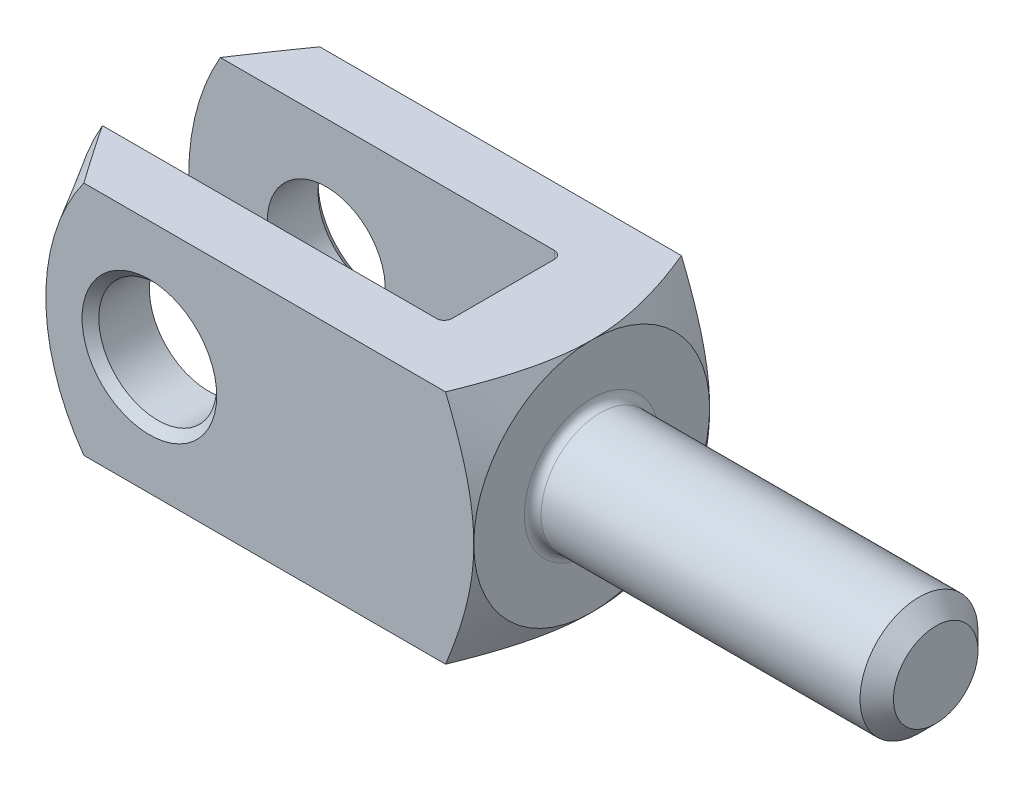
ISO-10303-21;
HEADER;
FILE_DESCRIPTION(('STEP AP214'),'2;1');
FILE_NAME('part.step','',(''),(''),'','','');
FILE_SCHEMA(('AUTOMOTIVE_DESIGN { 1 0 10303 214 1 1 1 1 }'));
ENDSEC;
DATA;
#1=APPLICATION_CONTEXT('core data for automotive mechanical design processes');
#2=APPLICATION_PROTOCOL_DEFINITION('international standard','automotive_design',2000,#1);
#3=PRODUCT_CONTEXT('',#1,'mechanical');
#4=PRODUCT('Part','Part','',(#3));
#5=PRODUCT_RELATED_PRODUCT_CATEGORY('part','',(#4));
#6=PRODUCT_DEFINITION_FORMATION('','',#4);
#7=PRODUCT_DEFINITION_CONTEXT('part definition',#1,'design');
#8=PRODUCT_DEFINITION('design','',#6,#7);
#9=PRODUCT_DEFINITION_SHAPE('','',#8);
#10=(LENGTH_UNIT() NAMED_UNIT(*) SI_UNIT(.MILLI.,.METRE.));
#11=(NAMED_UNIT(*) PLANE_ANGLE_UNIT() SI_UNIT($,.RADIAN.));
#12=(NAMED_UNIT(*) SI_UNIT($,.STERADIAN.) SOLID_ANGLE_UNIT());
#13=UNCERTAINTY_MEASURE_WITH_UNIT(LENGTH_MEASURE(1.E-05),#10,'distance_accuracy_value','');
#14=(GEOMETRIC_REPRESENTATION_CONTEXT(3) GLOBAL_UNCERTAINTY_ASSIGNED_CONTEXT((#13)) GLOBAL_UNIT_ASSIGNED_CONTEXT((#10,
#11,#12)) REPRESENTATION_CONTEXT('',''));
#15=CARTESIAN_POINT('',(0.,0.,0.));
#16=DIRECTION('',(0.,0.,1.));
#17=DIRECTION('',(1.,0.,0.));
#18=AXIS2_PLACEMENT_3D('',#15,#16,#17);
#19=CARTESIAN_POINT('',(-82.,-12.,-5.99999999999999));
#20=DIRECTION('',(0.,0.,-1.));
#21=DIRECTION('',(-1.,0.,0.));
#22=AXIS2_PLACEMENT_3D('',#19,#20,#21);
#23=PLANE('',#22);
#24=CARTESIAN_POINT('',(-68.,0.,-5.99999999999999));
#25=DIRECTION('',(0.,0.,-1.));
#26=DIRECTION('',(-1.,0.,0.));
#27=AXIS2_PLACEMENT_3D('',#24,#25,#26);
#28=CIRCLE('',#27,6.);
#29=CARTESIAN_POINT('',(-74.,0.,-5.99999999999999));
#30=VERTEX_POINT('',#29);
#31=EDGE_CURVE('E160',#30,#30,#28,.F.);
#32=ORIENTED_EDGE('',*,*,#31,.F.);
#33=EDGE_LOOP('',(#32));
#34=FACE_BOUND('',#33,.T.);
#35=DIRECTION('',(-1.,0.,0.));
#36=VECTOR('',#35,1.);
#37=CARTESIAN_POINT('',(-82.,12.,-5.99999999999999));
#38=LINE('',#37,#36);
#39=CARTESIAN_POINT('',(-44.8,12.,-5.99999999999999));
#40=VERTEX_POINT('',#39);
#41=CARTESIAN_POINT('',(-78.7846096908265,12.,-5.99999999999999));
#42=VERTEX_POINT('',#41);
#43=EDGE_CURVE('E322',#40,#42,#38,.T.);
#44=ORIENTED_EDGE('',*,*,#43,.T.);
#45=CARTESIAN_POINT('',(-58.,0.,-5.99999999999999));
#46=DIRECTION('',(0.,0.,1.));
#47=DIRECTION('',(1.,0.,0.));
#48=AXIS2_PLACEMENT_3D('',#45,#46,#47);
#49=CIRCLE('',#48,24.);
#50=CARTESIAN_POINT('',(-78.7846096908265,-12.,-5.99999999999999));
#51=VERTEX_POINT('',#50);
#52=EDGE_CURVE('E61',#42,#51,#49,.T.);
#53=ORIENTED_EDGE('',*,*,#52,.T.);
#54=DIRECTION('',(-1.,0.,0.));
#55=VECTOR('',#54,1.);
#56=CARTESIAN_POINT('',(-82.,-12.,-5.99999999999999));
#57=LINE('',#56,#55);
#58=CARTESIAN_POINT('',(-44.8,-12.,-5.99999999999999));
#59=VERTEX_POINT('',#58);
#60=EDGE_CURVE('E312',#59,#51,#57,.T.);
#61=ORIENTED_EDGE('',*,*,#60,.F.);
#62=DIRECTION('',(0.,1.,0.));
#63=VECTOR('',#62,1.);
#64=CARTESIAN_POINT('',(-44.8,12.,-5.99999999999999));
#65=LINE('',#64,#63);
#66=EDGE_CURVE('E183',#59,#40,#65,.T.);
#67=ORIENTED_EDGE('',*,*,#66,.T.);
#68=EDGE_LOOP('',(#44,#53,#61,#67));
#69=FACE_BOUND('',#68,.T.);
#70=ADVANCED_FACE('F37',(#34,#69),#23,.F.);
#71=CARTESIAN_POINT('',(-82.,-12.,6.00000000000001));
#72=DIRECTION('',(0.,0.,1.));
#73=DIRECTION('',(1.,0.,0.));
#74=AXIS2_PLACEMENT_3D('',#71,#72,#73);
#75=PLANE('',#74);
#76=CARTESIAN_POINT('',(-68.,0.,6.00000000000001));
#77=DIRECTION('',(0.,0.,1.));
#78=DIRECTION('',(1.,0.,0.));
#79=AXIS2_PLACEMENT_3D('',#76,#77,#78);
#80=CIRCLE('',#79,6.);
#81=CARTESIAN_POINT('',(-62.,0.,6.00000000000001));
#82=VERTEX_POINT('',#81);
#83=EDGE_CURVE('E164',#82,#82,#80,.F.);
#84=ORIENTED_EDGE('',*,*,#83,.F.);
#85=EDGE_LOOP('',(#84));
#86=FACE_BOUND('',#85,.T.);
#87=CARTESIAN_POINT('',(-58.,0.,6.00000000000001));
#88=DIRECTION('',(0.,0.,1.));
#89=DIRECTION('',(1.,0.,0.));
#90=AXIS2_PLACEMENT_3D('',#87,#88,#89);
#91=CIRCLE('',#90,24.);
#92=CARTESIAN_POINT('',(-78.7846096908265,12.,6.00000000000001));
#93=VERTEX_POINT('',#92);
#94=CARTESIAN_POINT('',(-78.7846096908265,-12.,6.00000000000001));
#95=VERTEX_POINT('',#94);
#96=EDGE_CURVE('E128',#93,#95,#91,.T.);
#97=ORIENTED_EDGE('',*,*,#96,.F.);
#98=DIRECTION('',(1.,0.,0.));
#99=VECTOR('',#98,1.);
#100=CARTESIAN_POINT('',(-82.,12.,6.00000000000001));
#101=LINE('',#100,#99);
#102=CARTESIAN_POINT('',(-44.8,12.,6.));
#103=VERTEX_POINT('',#102);
#104=EDGE_CURVE('E326',#93,#103,#101,.T.);
#105=ORIENTED_EDGE('',*,*,#104,.T.);
#106=DIRECTION('',(0.,1.,0.));
#107=VECTOR('',#106,1.);
#108=CARTESIAN_POINT('',(-44.8,-12.,6.));
#109=LINE('',#108,#107);
#110=CARTESIAN_POINT('',(-44.8,-12.,6.));
#111=VERTEX_POINT('',#110);
#112=EDGE_CURVE('E179',#103,#111,#109,.F.);
#113=ORIENTED_EDGE('',*,*,#112,.T.);
#114=DIRECTION('',(1.,0.,0.));
#115=VECTOR('',#114,1.);
#116=CARTESIAN_POINT('',(-82.,-12.,6.00000000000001));
#117=LINE('',#116,#115);
#118=EDGE_CURVE('E315',#95,#111,#117,.T.);
#119=ORIENTED_EDGE('',*,*,#118,.F.);
#120=EDGE_LOOP('',(#97,#105,#113,#119));
#121=FACE_BOUND('',#120,.T.);
#122=ADVANCED_FACE('F382',(#86,#121),#75,.F.);
#123=CARTESIAN_POINT('',(-82.,-12.,12.));
#124=DIRECTION('',(0.,0.,1.));
#125=DIRECTION('',(1.,0.,0.));
#126=AXIS2_PLACEMENT_3D('',#123,#124,#125);
#127=PLANE('',#126);
#128=CARTESIAN_POINT('',(-68.,0.,12.));
#129=DIRECTION('',(0.,0.,1.));
#130=DIRECTION('',(1.,0.,0.));
#131=AXIS2_PLACEMENT_3D('',#128,#129,#130);
#132=CIRCLE('',#131,6.85000000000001);
#133=CARTESIAN_POINT('',(-61.15,0.,12.));
#134=VERTEX_POINT('',#133);
#135=EDGE_CURVE('E220',#134,#134,#132,.F.);
#136=ORIENTED_EDGE('',*,*,#135,.T.);
#137=EDGE_LOOP('',(#136));
#138=FACE_BOUND('',#137,.T.);
#139=DIRECTION('',(1.,0.,0.));
#140=VECTOR('',#139,1.);
#141=CARTESIAN_POINT('',(-82.,12.,12.));
#142=LINE('',#141,#140);
#143=CARTESIAN_POINT('',(-74.6650269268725,12.,12.));
#144=VERTEX_POINT('',#143);
#145=CARTESIAN_POINT('',(-37.8697557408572,12.,12.));
#146=VERTEX_POINT('',#145);
#147=EDGE_CURVE('E142',#144,#146,#142,.T.);
#148=ORIENTED_EDGE('',*,*,#147,.F.);
#149=CARTESIAN_POINT('',(-58.,0.,12.));
#150=DIRECTION('',(0.,0.,1.));
#151=DIRECTION('',(1.,0.,0.));
#152=AXIS2_PLACEMENT_3D('',#149,#150,#151);
#153=CIRCLE('',#152,20.5358983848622);
#154=CARTESIAN_POINT('',(-74.6650269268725,-12.,12.));
#155=VERTEX_POINT('',#154);
#156=EDGE_CURVE('E53',#144,#155,#153,.T.);
#157=ORIENTED_EDGE('',*,*,#156,.T.);
#158=DIRECTION('',(1.,0.,0.));
#159=VECTOR('',#158,1.);
#160=CARTESIAN_POINT('',(-82.,-12.,12.));
#161=LINE('',#160,#159);
#162=CARTESIAN_POINT('',(-37.8697557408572,-12.,12.));
#163=VERTEX_POINT('',#162);
#164=EDGE_CURVE('E139',#155,#163,#161,.T.);
#165=ORIENTED_EDGE('',*,*,#164,.T.);
#166=CARTESIAN_POINT('',(-43.8270481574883,-24.508852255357,12.));
#167=CARTESIAN_POINT('',(-43.5204158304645,-23.9174203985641,12.));
#168=CARTESIAN_POINT('',(-43.2154046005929,-23.3251403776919,12.));
#169=CARTESIAN_POINT('',(-42.6094839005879,-22.1384473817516,12.));
#170=CARTESIAN_POINT('',(-42.3085746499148,-21.5440342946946,12.));
#171=CARTESIAN_POINT('',(-41.7112306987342,-20.3516642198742,12.));
#172=CARTESIAN_POINT('',(-41.4148047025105,-19.753702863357,12.));
#173=CARTESIAN_POINT('',(-40.8281918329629,-18.5547362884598,12.));
#174=CARTESIAN_POINT('',(-40.5380048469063,-17.9537311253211,12.));
#175=CARTESIAN_POINT('',(-39.9478447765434,-16.7109015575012,12.));
#176=CARTESIAN_POINT('',(-39.6483679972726,-16.0688406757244,12.));
#177=CARTESIAN_POINT('',(-39.0608191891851,-14.7794664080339,12.));
#178=CARTESIAN_POINT('',(-38.7727477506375,-14.132152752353,12.));
#179=CARTESIAN_POINT('',(-38.211729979,-12.8312921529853,12.));
#180=CARTESIAN_POINT('',(-37.9387769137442,-12.177748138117,12.));
#181=CARTESIAN_POINT('',(-37.5444276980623,-11.1914316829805,12.));
#182=CARTESIAN_POINT('',(-37.4154954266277,-10.8616706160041,12.));
#183=CARTESIAN_POINT('',(-37.1634870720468,-10.1999223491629,12.));
#184=CARTESIAN_POINT('',(-37.0404108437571,-9.86793520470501,12.));
#185=CARTESIAN_POINT('',(-36.7750973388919,-9.12924658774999,12.));
#186=CARTESIAN_POINT('',(-36.6344928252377,-8.72195527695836,12.));
#187=CARTESIAN_POINT('',(-36.3653837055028,-7.90341175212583,12.));
#188=CARTESIAN_POINT('',(-36.2368780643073,-7.49215988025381,12.));
#189=CARTESIAN_POINT('',(-35.99435151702,-6.66538582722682,12.));
#190=CARTESIAN_POINT('',(-35.8803303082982,-6.24986373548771,12.));
#191=CARTESIAN_POINT('',(-35.6694959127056,-5.41444148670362,12.));
#192=CARTESIAN_POINT('',(-35.5726825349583,-4.99454137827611,12.));
#193=CARTESIAN_POINT('',(-35.4012191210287,-4.16046851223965,12.));
#194=CARTESIAN_POINT('',(-35.3261021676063,-3.74639268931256,12.));
#195=CARTESIAN_POINT('',(-35.1977094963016,-2.91483992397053,12.));
#196=CARTESIAN_POINT('',(-35.1444330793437,-2.49736309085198,12.));
#197=CARTESIAN_POINT('',(-35.061948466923,-1.66028284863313,12.));
#198=CARTESIAN_POINT('',(-35.032724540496,-1.24068101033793,12.));
#199=CARTESIAN_POINT('',(-34.9996341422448,-0.400474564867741,12.));
#200=CARTESIAN_POINT('',(-34.9957667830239,0.0201300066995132,12.));
#201=CARTESIAN_POINT('',(-35.0129154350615,0.830148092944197,12.));
#202=CARTESIAN_POINT('',(-35.0321388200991,1.21960118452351,12.));
#203=CARTESIAN_POINT('',(-35.091746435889,1.99686728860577,12.));
#204=CARTESIAN_POINT('',(-35.1321306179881,2.38468030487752,12.));
#205=CARTESIAN_POINT('',(-35.232579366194,3.15792367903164,12.));
#206=CARTESIAN_POINT('',(-35.2926540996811,3.54335270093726,12.));
#207=CARTESIAN_POINT('',(-35.4305032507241,4.31101186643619,12.));
#208=CARTESIAN_POINT('',(-35.5082781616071,4.69324192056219,12.));
#209=CARTESIAN_POINT('',(-35.6818401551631,5.46519444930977,12.));
#210=CARTESIAN_POINT('',(-35.7780834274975,5.85481356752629,12.));
#211=CARTESIAN_POINT('',(-35.9846981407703,6.63026168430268,12.));
#212=CARTESIAN_POINT('',(-36.0950697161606,7.01609064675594,12.));
#213=CARTESIAN_POINT('',(-36.327805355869,7.78407900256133,12.));
#214=CARTESIAN_POINT('',(-36.450168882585,8.16623855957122,12.));
#215=CARTESIAN_POINT('',(-36.6413066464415,8.73690278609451,12.));
#216=CARTESIAN_POINT('',(-36.706283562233,8.92669203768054,12.));
#217=CARTESIAN_POINT('',(-36.8385670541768,9.30545658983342,12.));
#218=CARTESIAN_POINT('',(-36.9058736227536,9.49443189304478,12.));
#219=CARTESIAN_POINT('',(-37.1221378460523,10.09093133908,12.));
#220=CARTESIAN_POINT('',(-37.2750221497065,10.4970351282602,12.));
#221=CARTESIAN_POINT('',(-37.5890916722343,11.3060297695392,12.));
#222=CARTESIAN_POINT('',(-37.750277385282,11.7089204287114,12.));
#223=CARTESIAN_POINT('',(-38.0796092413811,12.5119467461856,12.));
#224=CARTESIAN_POINT('',(-38.2477569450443,12.9120817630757,12.));
#225=CARTESIAN_POINT('',(-38.5898549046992,13.7098486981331,12.));
#226=CARTESIAN_POINT('',(-38.7638050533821,14.1074806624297,12.));
#227=CARTESIAN_POINT('',(-39.1167497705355,14.900905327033,12.));
#228=CARTESIAN_POINT('',(-39.2957485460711,15.296696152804,12.));
#229=CARTESIAN_POINT('',(-39.6579079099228,16.0863711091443,12.));
#230=CARTESIAN_POINT('',(-39.841068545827,16.4802552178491,12.));
#231=CARTESIAN_POINT('',(-40.3958010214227,17.6593177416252,12.));
#232=CARTESIAN_POINT('',(-40.7726679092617,18.4420054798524,12.));
#233=CARTESIAN_POINT('',(-41.5379796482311,20.004634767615,12.));
#234=CARTESIAN_POINT('',(-41.9264562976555,20.7845606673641,12.));
#235=CARTESIAN_POINT('',(-42.7113669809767,22.3404133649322,12.));
#236=CARTESIAN_POINT('',(-43.107801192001,23.1163400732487,12.));
#237=CARTESIAN_POINT('',(-43.9066094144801,24.6646398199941,12.));
#238=CARTESIAN_POINT('',(-44.3089803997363,25.4370144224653,12.));
#239=CARTESIAN_POINT('',(-45.1185505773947,26.9792185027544,12.));
#240=CARTESIAN_POINT('',(-45.5257497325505,27.7490480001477,12.));
#241=CARTESIAN_POINT('',(-46.6315922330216,29.8271201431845,12.));
#242=CARTESIAN_POINT('',(-47.3338843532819,31.1334202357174,12.));
#243=CARTESIAN_POINT('',(-48.7463886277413,33.7419610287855,12.));
#244=CARTESIAN_POINT('',(-49.4566018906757,35.0442011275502,12.));
#245=CARTESIAN_POINT('',(-50.8786764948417,37.6380871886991,12.));
#246=CARTESIAN_POINT('',(-51.5905050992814,38.9297511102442,12.));
#247=CARTESIAN_POINT('',(-52.6613936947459,40.865371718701,12.));
#248=CARTESIAN_POINT('',(-53.0188525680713,41.5102153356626,12.));
#249=CARTESIAN_POINT('',(-53.7347123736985,42.799378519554,12.));
#250=CARTESIAN_POINT('',(-54.0931133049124,43.4436980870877,12.));
#251=CARTESIAN_POINT('',(-54.4519232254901,44.0877898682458,12.));
#252=B_SPLINE_CURVE_WITH_KNOTS('',3,(#166,#167,#168,#169,#170,#171,#172,#173,#174,#175,#176,
#177,#178,#179,#180,#181,#182,#183,#184,#185,#186,#187,#188,#189,#190,#191,#192,#193,#194,#195,
#196,#197,#198,#199,#200,#201,#202,#203,#204,#205,#206,#207,#208,#209,#210,#211,#212,#213,#214,
#215,#216,#217,#218,#219,#220,#221,#222,#223,#224,#225,#226,#227,#228,#229,#230,#231,#232,#233,
#234,#235,#236,#237,#238,#239,#240,#241,#242,#243,#244,#245,#246,#247,#248,#249,#250,#251),
.UNSPECIFIED.,.F.,.F.,(4,2,2,2,2,2,2,2,2,2,2,2,2,2,2,2,2,2,2,2,2,2,2,2,2,2,2,2,2,2,2,2,2,2,2,2,
2,2,2,2,2,2,4),(0.,1.99859095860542,3.9972884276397,5.99946635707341,8.00160807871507,
10.1269271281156,12.2523560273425,14.3768307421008,15.4389968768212,16.501136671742,
17.793611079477,19.0859748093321,20.3783115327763,21.6706339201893,22.9326201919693,
24.194566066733,25.4556859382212,26.7167616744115,27.8859474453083,29.0551305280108,
30.2249182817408,31.3947386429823,32.5984184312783,33.8021096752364,35.0057469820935,
35.6075466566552,36.209344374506,37.51100701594,38.8127472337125,40.1147808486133,
41.4167903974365,42.719918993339,44.0230624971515,46.6290236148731,49.2429304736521,
51.8568955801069,54.469571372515,57.0822270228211,61.5315331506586,65.9814700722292,
70.4059202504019,72.6177970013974,74.8296711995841),.UNSPECIFIED.);
#253=CARTESIAN_POINT('',(-35.,0.,12.));
#254=VERTEX_POINT('',#253);
#255=EDGE_CURVE('E284',#254,#163,#252,.F.);
#256=ORIENTED_EDGE('',*,*,#255,.F.);
#257=EDGE_CURVE('E282',#146,#254,#252,.F.);
#258=ORIENTED_EDGE('',*,*,#257,.F.);
#259=EDGE_LOOP('',(#148,#157,#165,#256,#258));
#260=FACE_BOUND('',#259,.T.);
#261=ADVANCED_FACE('F137',(#138,#260),#127,.T.);
#262=CARTESIAN_POINT('',(-82.,-12.,12.));
#263=DIRECTION('',(0.,-1.,0.));
#264=DIRECTION('',(0.,0.,-1.));
#265=AXIS2_PLACEMENT_3D('',#262,#263,#264);
#266=PLANE('',#265);
#267=ORIENTED_EDGE('',*,*,#60,.T.);
#268=CARTESIAN_POINT('',(-88.2786029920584,-12.,8.84338025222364));
#269=CARTESIAN_POINT('',(-87.6947368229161,-12.,7.90330325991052));
#270=CARTESIAN_POINT('',(-87.1092717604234,-12.,6.96421474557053));
#271=CARTESIAN_POINT('',(-85.9343954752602,-12.,5.08848378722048));
#272=CARTESIAN_POINT('',(-85.3449841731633,-12.,4.15184139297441));
#273=CARTESIAN_POINT('',(-84.1607841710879,-12.,2.28039346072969));
#274=CARTESIAN_POINT('',(-83.565989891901,-12.,1.34559145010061));
#275=CARTESIAN_POINT('',(-82.3707199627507,-12.,-0.520365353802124));
#276=CARTESIAN_POINT('',(-81.7702443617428,-12.,-1.4515201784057));
#277=CARTESIAN_POINT('',(-80.5371594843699,-12.,-3.34796497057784));
#278=CARTESIAN_POINT('',(-79.9042532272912,-12.,-4.31306203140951));
#279=CARTESIAN_POINT('',(-78.6288928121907,-12.,-6.23692872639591));
#280=CARTESIAN_POINT('',(-77.9864387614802,-12.,-7.19569843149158));
#281=CARTESIAN_POINT('',(-77.0137395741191,-12.,-8.62721356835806));
#282=CARTESIAN_POINT('',(-76.6881242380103,-12.,-9.10310585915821));
#283=CARTESIAN_POINT('',(-76.0333476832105,-12.,-10.0524433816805));
#284=CARTESIAN_POINT('',(-75.7041864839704,-12.,-10.5258886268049));
#285=CARTESIAN_POINT('',(-75.0417887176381,-12.,-11.4698924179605));
#286=CARTESIAN_POINT('',(-74.7085523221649,-12.,-11.9404510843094));
#287=CARTESIAN_POINT('',(-74.0373266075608,-12.,-12.8781628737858));
#288=CARTESIAN_POINT('',(-73.6993373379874,-12.,-13.3453160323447));
#289=CARTESIAN_POINT('',(-73.0209560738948,-12.,-14.271205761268));
#290=CARTESIAN_POINT('',(-72.6806158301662,-12.,-14.7299801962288));
#291=CARTESIAN_POINT('',(-71.9934550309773,-12.,-15.6426726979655));
#292=CARTESIAN_POINT('',(-71.6466343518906,-12.,-16.096590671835));
#293=CARTESIAN_POINT('',(-70.9447774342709,-12.,-16.9990439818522));
#294=CARTESIAN_POINT('',(-70.5897305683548,-12.,-17.4475710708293));
#295=CARTESIAN_POINT('',(-69.8702804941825,-12.,-18.3370436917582));
#296=CARTESIAN_POINT('',(-69.5058777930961,-12.,-18.7779896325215));
#297=CARTESIAN_POINT('',(-68.7694365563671,-12.,-19.6456462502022));
#298=CARTESIAN_POINT('',(-68.3975164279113,-12.,-20.0724571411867));
#299=CARTESIAN_POINT('',(-67.6396530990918,-12.,-20.9137472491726));
#300=CARTESIAN_POINT('',(-67.2537063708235,-12.,-21.3282233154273));
#301=CARTESIAN_POINT('',(-66.6621255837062,-12.,-21.9367708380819));
#302=CARTESIAN_POINT('',(-66.4630426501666,-12.,-22.137217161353));
#303=CARTESIAN_POINT('',(-66.0599745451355,-12.,-22.5331099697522));
#304=CARTESIAN_POINT('',(-65.855989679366,-12.,-22.7285567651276));
#305=CARTESIAN_POINT('',(-65.4425971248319,-12.,-23.1134290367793));
#306=CARTESIAN_POINT('',(-65.2331922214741,-12.,-23.3028574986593));
#307=CARTESIAN_POINT('',(-64.8081788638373,-12.,-23.67459803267));
#308=CARTESIAN_POINT('',(-64.5925713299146,-12.,-23.8569111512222));
#309=CARTESIAN_POINT('',(-64.2600203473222,-12.,-24.1270885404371));
#310=CARTESIAN_POINT('',(-64.1456331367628,-12.,-24.2181054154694));
#311=CARTESIAN_POINT('',(-63.9148670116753,-12.,-24.3975755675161));
#312=CARTESIAN_POINT('',(-63.7984881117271,-12.,-24.4860288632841));
#313=CARTESIAN_POINT('',(-63.446141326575,-12.,-24.7471697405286));
#314=CARTESIAN_POINT('',(-63.2069947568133,-12.,-24.9156125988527));
#315=CARTESIAN_POINT('',(-62.7195001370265,-12.,-25.2383188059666));
#316=CARTESIAN_POINT('',(-62.4711595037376,-12.,-25.3925932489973));
#317=CARTESIAN_POINT('',(-61.964514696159,-12.,-25.6835963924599));
#318=CARTESIAN_POINT('',(-61.7062131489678,-12.,-25.8203296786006));
#319=CARTESIAN_POINT('',(-61.0356348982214,-12.,-26.1405466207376));
#320=CARTESIAN_POINT('',(-60.6158504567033,-12.,-26.3091476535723));
#321=CARTESIAN_POINT('',(-59.9703142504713,-12.,-26.5095003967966));
#322=CARTESIAN_POINT('',(-59.7525810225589,-12.,-26.5675140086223));
#323=CARTESIAN_POINT('',(-59.3127569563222,-12.,-26.6640173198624));
#324=CARTESIAN_POINT('',(-59.0906663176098,-12.,-26.702507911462));
#325=CARTESIAN_POINT('',(-58.641579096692,-12.,-26.7585747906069));
#326=CARTESIAN_POINT('',(-58.414555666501,-12.,-26.7759381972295));
#327=CARTESIAN_POINT('',(-57.9599023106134,-12.,-26.7882217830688));
#328=CARTESIAN_POINT('',(-57.7322724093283,-12.,-26.7831428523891));
#329=CARTESIAN_POINT('',(-57.2785688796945,-12.,-26.7507852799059));
#330=CARTESIAN_POINT('',(-57.0524955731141,-12.,-26.7235021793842));
#331=CARTESIAN_POINT('',(-56.6038899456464,-12.,-26.6479928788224));
#332=CARTESIAN_POINT('',(-56.3813581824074,-12.,-26.5997634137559));
#333=CARTESIAN_POINT('',(-55.900551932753,-12.,-26.4736338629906));
#334=CARTESIAN_POINT('',(-55.64328906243,-12.,-26.3918933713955));
#335=CARTESIAN_POINT('',(-55.1371308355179,-12.,-26.2055998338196));
#336=CARTESIAN_POINT('',(-54.8882402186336,-12.,-26.1010341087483));
#337=CARTESIAN_POINT('',(-54.3986617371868,-12.,-25.8726383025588));
#338=CARTESIAN_POINT('',(-54.157999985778,-12.,-25.7487527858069));
#339=CARTESIAN_POINT('',(-53.6854799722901,-12.,-25.485398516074));
#340=CARTESIAN_POINT('',(-53.453620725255,-12.,-25.3459315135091));
#341=CARTESIAN_POINT('',(-52.9233788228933,-12.,-25.0064399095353));
#342=CARTESIAN_POINT('',(-52.6281184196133,-12.,-24.8015559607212));
#343=CARTESIAN_POINT('',(-52.0502738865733,-12.,-24.374546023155));
#344=CARTESIAN_POINT('',(-51.7676958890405,-12.,-24.1524118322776));
#345=CARTESIAN_POINT('',(-51.2130794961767,-12.,-23.6943719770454));
#346=CARTESIAN_POINT('',(-50.941062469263,-12.,-23.4584405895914));
#347=CARTESIAN_POINT('',(-50.406626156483,-12.,-22.9760898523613));
#348=CARTESIAN_POINT('',(-50.1442052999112,-12.,-22.7296722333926));
#349=CARTESIAN_POINT('',(-49.6258300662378,-12.,-22.2267453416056));
#350=CARTESIAN_POINT('',(-49.3699307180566,-12.,-21.9701795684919));
#351=CARTESIAN_POINT('',(-48.8652654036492,-12.,-21.4501311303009));
#352=CARTESIAN_POINT('',(-48.616499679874,-12.,-21.1866482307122));
#353=CARTESIAN_POINT('',(-48.1253910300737,-12.,-20.6542828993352));
#354=CARTESIAN_POINT('',(-47.8830417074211,-12.,-20.3854063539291));
#355=CARTESIAN_POINT('',(-47.4036952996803,-12.,-19.8429441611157));
#356=CARTESIAN_POINT('',(-47.1666981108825,-12.,-19.5693586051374));
#357=CARTESIAN_POINT('',(-46.6001496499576,-12.,-18.9040671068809));
#358=CARTESIAN_POINT('',(-46.2729278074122,-12.,-18.5103784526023));
#359=CARTESIAN_POINT('',(-45.626186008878,-12.,-17.7166170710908));
#360=CARTESIAN_POINT('',(-45.3066675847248,-12.,-17.316543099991));
#361=CARTESIAN_POINT('',(-44.679005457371,-12.,-16.5174455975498));
#362=CARTESIAN_POINT('',(-44.3707624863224,-12.,-16.1184998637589));
#363=CARTESIAN_POINT('',(-43.7597996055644,-12.,-15.316589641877));
#364=CARTESIAN_POINT('',(-43.457078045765,-12.,-14.9136264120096));
#365=CARTESIAN_POINT('',(-43.1566197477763,-12.,-14.5090044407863));
#366=B_SPLINE_CURVE_WITH_KNOTS('',3,(#268,#269,#270,#271,#272,#273,#274,#275,#276,#277,#278,
#279,#280,#281,#282,#283,#284,#285,#286,#287,#288,#289,#290,#291,#292,#293,#294,#295,#296,#297,
#298,#299,#300,#301,#302,#303,#304,#305,#306,#307,#308,#309,#310,#311,#312,#313,#314,#315,#316,
#317,#318,#319,#320,#321,#322,#323,#324,#325,#326,#327,#328,#329,#330,#331,#332,#333,#334,#335,
#336,#337,#338,#339,#340,#341,#342,#343,#344,#345,#346,#347,#348,#349,#350,#351,#352,#353,#354,
#355,#356,#357,#358,#359,#360,#361,#362,#363,#364,#365),.UNSPECIFIED.,.F.,.F.,(4,2,2,2,2,2,2,2,
2,2,2,2,2,2,2,2,2,2,2,2,2,2,2,2,2,2,2,2,2,2,2,2,2,2,2,2,2,2,2,2,2,2,2,2,2,2,2,2,4),(0.,
3.31991386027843,6.63989474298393,9.96383874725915,13.2877541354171,16.7500600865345,
20.2123271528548,21.9421957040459,23.6720547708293,25.4018412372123,27.1316096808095,
28.8452569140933,30.5589368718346,32.2749700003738,33.9909103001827,35.6890521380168,
37.3876240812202,38.2350900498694,39.0825033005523,39.9294893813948,40.7763504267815,
41.2148575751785,41.6533615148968,42.5304910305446,43.4069277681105,44.2831349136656,
45.6347123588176,46.3099700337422,46.9851968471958,47.667172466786,48.3491210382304,
49.031206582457,49.7133984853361,50.5219110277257,51.3308738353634,52.1422020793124,
52.9534392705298,54.0307393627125,55.1085548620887,56.1884481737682,57.2681639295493,
58.3551054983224,59.4420839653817,60.5279345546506,61.6137640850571,63.1494038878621,
64.6853465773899,66.1977597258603,67.7097132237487),.UNSPECIFIED.);
#367=CARTESIAN_POINT('',(-74.6650269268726,-12.,-12.));
#368=VERTEX_POINT('',#367);
#369=EDGE_CURVE('E133',#51,#368,#366,.T.);
#370=ORIENTED_EDGE('',*,*,#369,.T.);
#371=DIRECTION('',(1.,0.,0.));
#372=VECTOR('',#371,1.);
#373=CARTESIAN_POINT('',(-82.,-12.,-12.));
#374=LINE('',#373,#372);
#375=CARTESIAN_POINT('',(-37.8697557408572,-12.,-12.));
#376=VERTEX_POINT('',#375);
#377=EDGE_CURVE('E152',#368,#376,#374,.T.);
#378=ORIENTED_EDGE('',*,*,#377,.T.);
#379=CARTESIAN_POINT('',(-43.8270481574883,-12.,-24.508852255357));
#380=CARTESIAN_POINT('',(-43.5204158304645,-12.,-23.9174203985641));
#381=CARTESIAN_POINT('',(-43.2154046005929,-12.,-23.3251403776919));
#382=CARTESIAN_POINT('',(-42.6094839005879,-12.,-22.1384473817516));
#383=CARTESIAN_POINT('',(-42.3085746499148,-12.,-21.5440342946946));
#384=CARTESIAN_POINT('',(-41.7112306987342,-12.,-20.3516642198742));
#385=CARTESIAN_POINT('',(-41.4148047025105,-12.,-19.753702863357));
#386=CARTESIAN_POINT('',(-40.8281918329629,-12.,-18.5547362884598));
#387=CARTESIAN_POINT('',(-40.5380048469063,-12.,-17.9537311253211));
#388=CARTESIAN_POINT('',(-39.9478447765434,-12.,-16.7109015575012));
#389=CARTESIAN_POINT('',(-39.6483679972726,-12.,-16.0688406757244));
#390=CARTESIAN_POINT('',(-39.0608191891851,-12.,-14.7794664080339));
#391=CARTESIAN_POINT('',(-38.7727477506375,-12.,-14.132152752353));
#392=CARTESIAN_POINT('',(-38.211729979,-12.,-12.8312921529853));
#393=CARTESIAN_POINT('',(-37.9387769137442,-12.,-12.177748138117));
#394=CARTESIAN_POINT('',(-37.5444276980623,-12.,-11.1914316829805));
#395=CARTESIAN_POINT('',(-37.4154954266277,-12.,-10.8616706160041));
#396=CARTESIAN_POINT('',(-37.1634870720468,-12.,-10.1999223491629));
#397=CARTESIAN_POINT('',(-37.0404108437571,-12.,-9.86793520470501));
#398=CARTESIAN_POINT('',(-36.7750973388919,-12.,-9.12924658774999));
#399=CARTESIAN_POINT('',(-36.6344928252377,-12.,-8.72195527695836));
#400=CARTESIAN_POINT('',(-36.3653837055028,-12.,-7.90341175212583));
#401=CARTESIAN_POINT('',(-36.2368780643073,-12.,-7.49215988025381));
#402=CARTESIAN_POINT('',(-35.99435151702,-12.,-6.66538582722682));
#403=CARTESIAN_POINT('',(-35.8803303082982,-12.,-6.24986373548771));
#404=CARTESIAN_POINT('',(-35.6694959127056,-12.,-5.41444148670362));
#405=CARTESIAN_POINT('',(-35.5726825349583,-12.,-4.99454137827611));
#406=CARTESIAN_POINT('',(-35.4012191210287,-12.,-4.16046851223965));
#407=CARTESIAN_POINT('',(-35.3261021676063,-12.,-3.74639268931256));
#408=CARTESIAN_POINT('',(-35.1977094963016,-12.,-2.91483992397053));
#409=CARTESIAN_POINT('',(-35.1444330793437,-12.,-2.49736309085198));
#410=CARTESIAN_POINT('',(-35.061948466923,-12.,-1.66028284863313));
#411=CARTESIAN_POINT('',(-35.032724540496,-12.,-1.24068101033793));
#412=CARTESIAN_POINT('',(-34.9996341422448,-12.,-0.400474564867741));
#413=CARTESIAN_POINT('',(-34.9957667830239,-12.,0.0201300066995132));
#414=CARTESIAN_POINT('',(-35.0129154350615,-12.,0.830148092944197));
#415=CARTESIAN_POINT('',(-35.0321388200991,-12.,1.21960118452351));
#416=CARTESIAN_POINT('',(-35.091746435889,-12.,1.99686728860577));
#417=CARTESIAN_POINT('',(-35.1321306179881,-12.,2.38468030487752));
#418=CARTESIAN_POINT('',(-35.232579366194,-12.,3.15792367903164));
#419=CARTESIAN_POINT('',(-35.2926540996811,-12.,3.54335270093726));
#420=CARTESIAN_POINT('',(-35.4305032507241,-12.,4.31101186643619));
#421=CARTESIAN_POINT('',(-35.5082781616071,-12.,4.69324192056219));
#422=CARTESIAN_POINT('',(-35.6818401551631,-12.,5.46519444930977));
#423=CARTESIAN_POINT('',(-35.7780834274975,-12.,5.85481356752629));
#424=CARTESIAN_POINT('',(-35.9846981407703,-12.,6.63026168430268));
#425=CARTESIAN_POINT('',(-36.0950697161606,-12.,7.01609064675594));
#426=CARTESIAN_POINT('',(-36.327805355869,-12.,7.78407900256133));
#427=CARTESIAN_POINT('',(-36.450168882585,-12.,8.16623855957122));
#428=CARTESIAN_POINT('',(-36.6413066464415,-12.,8.73690278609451));
#429=CARTESIAN_POINT('',(-36.706283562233,-12.,8.92669203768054));
#430=CARTESIAN_POINT('',(-36.8385670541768,-12.,9.30545658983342));
#431=CARTESIAN_POINT('',(-36.9058736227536,-12.,9.49443189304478));
#432=CARTESIAN_POINT('',(-37.1221378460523,-12.,10.09093133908));
#433=CARTESIAN_POINT('',(-37.2750221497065,-12.,10.4970351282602));
#434=CARTESIAN_POINT('',(-37.5890916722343,-12.,11.3060297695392));
#435=CARTESIAN_POINT('',(-37.750277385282,-12.,11.7089204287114));
#436=CARTESIAN_POINT('',(-38.0796092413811,-12.,12.5119467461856));
#437=CARTESIAN_POINT('',(-38.2477569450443,-12.,12.9120817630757));
#438=CARTESIAN_POINT('',(-38.5898549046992,-12.,13.7098486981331));
#439=CARTESIAN_POINT('',(-38.7638050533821,-12.,14.1074806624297));
#440=CARTESIAN_POINT('',(-39.1167497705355,-12.,14.900905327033));
#441=CARTESIAN_POINT('',(-39.2957485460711,-12.,15.296696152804));
#442=CARTESIAN_POINT('',(-39.6579079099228,-12.,16.0863711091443));
#443=CARTESIAN_POINT('',(-39.841068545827,-12.,16.4802552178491));
#444=CARTESIAN_POINT('',(-40.3958010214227,-12.,17.6593177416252));
#445=CARTESIAN_POINT('',(-40.7726679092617,-12.,18.4420054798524));
#446=CARTESIAN_POINT('',(-41.5379796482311,-12.,20.004634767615));
#447=CARTESIAN_POINT('',(-41.9264562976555,-12.,20.7845606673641));
#448=CARTESIAN_POINT('',(-42.7113669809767,-12.,22.3404133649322));
#449=CARTESIAN_POINT('',(-43.107801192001,-12.,23.1163400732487));
#450=CARTESIAN_POINT('',(-43.9066094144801,-12.,24.6646398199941));
#451=CARTESIAN_POINT('',(-44.3089803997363,-12.,25.4370144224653));
#452=CARTESIAN_POINT('',(-45.1185505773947,-12.,26.9792185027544));
#453=CARTESIAN_POINT('',(-45.5257497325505,-12.,27.7490480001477));
#454=CARTESIAN_POINT('',(-46.6315922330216,-12.,29.8271201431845));
#455=CARTESIAN_POINT('',(-47.3338843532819,-12.,31.1334202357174));
#456=CARTESIAN_POINT('',(-48.7463886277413,-12.,33.7419610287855));
#457=CARTESIAN_POINT('',(-49.4566018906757,-12.,35.0442011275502));
#458=CARTESIAN_POINT('',(-50.8786764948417,-12.,37.6380871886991));
#459=CARTESIAN_POINT('',(-51.5905050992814,-12.,38.9297511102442));
#460=CARTESIAN_POINT('',(-52.6613936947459,-12.,40.865371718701));
#461=CARTESIAN_POINT('',(-53.0188525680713,-12.,41.5102153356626));
#462=CARTESIAN_POINT('',(-53.7347123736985,-12.,42.799378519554));
#463=CARTESIAN_POINT('',(-54.0931133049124,-12.,43.4436980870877));
#464=CARTESIAN_POINT('',(-54.4519232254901,-12.,44.0877898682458));
#465=B_SPLINE_CURVE_WITH_KNOTS('',3,(#379,#380,#381,#382,#383,#384,#385,#386,#387,#388,#389,
#390,#391,#392,#393,#394,#395,#396,#397,#398,#399,#400,#401,#402,#403,#404,#405,#406,#407,#408,
#409,#410,#411,#412,#413,#414,#415,#416,#417,#418,#419,#420,#421,#422,#423,#424,#425,#426,#427,
#428,#429,#430,#431,#432,#433,#434,#435,#436,#437,#438,#439,#440,#441,#442,#443,#444,#445,#446,
#447,#448,#449,#450,#451,#452,#453,#454,#455,#456,#457,#458,#459,#460,#461,#462,#463,#464),
.UNSPECIFIED.,.F.,.F.,(4,2,2,2,2,2,2,2,2,2,2,2,2,2,2,2,2,2,2,2,2,2,2,2,2,2,2,2,2,2,2,2,2,2,2,2,
2,2,2,2,2,2,4),(0.,1.99859095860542,3.9972884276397,5.99946635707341,8.00160807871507,
10.1269271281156,12.2523560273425,14.3768307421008,15.4389968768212,16.501136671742,
17.793611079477,19.0859748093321,20.3783115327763,21.6706339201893,22.9326201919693,
24.194566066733,25.4556859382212,26.7167616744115,27.8859474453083,29.0551305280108,
30.2249182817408,31.3947386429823,32.5984184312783,33.8021096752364,35.0057469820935,
35.6075466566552,36.209344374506,37.51100701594,38.8127472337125,40.1147808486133,
41.4167903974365,42.719918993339,44.0230624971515,46.6290236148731,49.2429304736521,
51.8568955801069,54.469571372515,57.0822270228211,61.5315331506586,65.9814700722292,
70.4059202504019,72.6177970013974,74.8296711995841),.UNSPECIFIED.);
#466=CARTESIAN_POINT('',(-35.,-12.,0.));
#467=VERTEX_POINT('',#466);
#468=EDGE_CURVE('E283',#467,#376,#465,.F.);
#469=ORIENTED_EDGE('',*,*,#468,.F.);
#470=EDGE_CURVE('E150',#163,#467,#465,.F.);
#471=ORIENTED_EDGE('',*,*,#470,.F.);
#472=ORIENTED_EDGE('',*,*,#164,.F.);
#473=CARTESIAN_POINT('',(-43.1566197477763,-12.,14.5090044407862));
#474=CARTESIAN_POINT('',(-43.4006935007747,-12.,14.8377253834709));
#475=CARTESIAN_POINT('',(-43.646275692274,-12.,15.1653349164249));
#476=CARTESIAN_POINT('',(-44.1409326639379,-12.,15.8179416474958));
#477=CARTESIAN_POINT('',(-44.3900076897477,-12.,16.142938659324));
#478=CARTESIAN_POINT('',(-44.8925369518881,-12.,16.7904580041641));
#479=CARTESIAN_POINT('',(-45.1459981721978,-12.,17.1129749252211));
#480=CARTESIAN_POINT('',(-45.6574352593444,-12.,17.7544019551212));
#481=CARTESIAN_POINT('',(-45.9154110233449,-12.,18.0733121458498));
#482=CARTESIAN_POINT('',(-46.439130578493,-12.,18.7099803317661));
#483=CARTESIAN_POINT('',(-46.70492584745,-12.,19.0276960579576));
#484=CARTESIAN_POINT('',(-47.2426663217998,-12.,19.6578767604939));
#485=CARTESIAN_POINT('',(-47.5146113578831,-12.,19.9703418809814));
#486=CARTESIAN_POINT('',(-48.0655161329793,-12.,20.5886723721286));
#487=CARTESIAN_POINT('',(-48.3444711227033,-12.,20.8945419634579));
#488=CARTESIAN_POINT('',(-48.9108142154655,-12.,21.4983473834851));
#489=CARTESIAN_POINT('',(-49.1982014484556,-12.,21.7962840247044));
#490=CARTESIAN_POINT('',(-49.7368573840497,-12.,22.3359554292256));
#491=CARTESIAN_POINT('',(-49.9866698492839,-12.,22.5791402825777));
#492=CARTESIAN_POINT('',(-50.4945610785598,-12.,23.0568078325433));
#493=CARTESIAN_POINT('',(-50.7526406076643,-12.,23.2912897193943));
#494=CARTESIAN_POINT('',(-51.2785039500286,-12.,23.7494696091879));
#495=CARTESIAN_POINT('',(-51.5462931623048,-12.,23.9731614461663));
#496=CARTESIAN_POINT('',(-52.092915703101,-12.,24.4066687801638));
#497=CARTESIAN_POINT('',(-52.3717476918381,-12.,24.6164859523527));
#498=CARTESIAN_POINT('',(-52.9019016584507,-12.,24.9899890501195));
#499=CARTESIAN_POINT('',(-53.1515693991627,-12.,25.156010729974));
#500=CARTESIAN_POINT('',(-53.6612415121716,-12.,25.4716054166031));
#501=CARTESIAN_POINT('',(-53.9212474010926,-12.,25.6211759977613));
#502=CARTESIAN_POINT('',(-54.4513266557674,-12.,25.8992289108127));
#503=CARTESIAN_POINT('',(-54.7213645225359,-12.,26.0277782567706));
#504=CARTESIAN_POINT('',(-55.2721724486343,-12.,26.2593735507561));
#505=CARTESIAN_POINT('',(-55.5529357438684,-12.,26.36243527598));
#506=CARTESIAN_POINT('',(-56.033924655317,-12.,26.5101311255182));
#507=CARTESIAN_POINT('',(-56.2316480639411,-12.,26.5629427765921));
#508=CARTESIAN_POINT('',(-56.63071076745,-12.,26.6525383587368));
#509=CARTESIAN_POINT('',(-56.832049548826,-12.,26.6893245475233));
#510=CARTESIAN_POINT('',(-57.23702442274,-12.,26.7455720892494));
#511=CARTESIAN_POINT('',(-57.4406589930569,-12.,26.7650443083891));
#512=CARTESIAN_POINT('',(-57.8488647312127,-12.,26.785964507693));
#513=CARTESIAN_POINT('',(-58.053435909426,-12.,26.7874122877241));
#514=CARTESIAN_POINT('',(-58.461994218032,-12.,26.7722217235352));
#515=CARTESIAN_POINT('',(-58.6659810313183,-12.,26.7555749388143));
#516=CARTESIAN_POINT('',(-59.0717491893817,-12.,26.7048226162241));
#517=CARTESIAN_POINT('',(-59.2735305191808,-12.,26.6707169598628));
#518=CARTESIAN_POINT('',(-59.6737302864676,-12.,26.586233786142));
#519=CARTESIAN_POINT('',(-59.872147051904,-12.,26.5358484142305));
#520=CARTESIAN_POINT('',(-60.2646355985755,-12.,26.4203795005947));
#521=CARTESIAN_POINT('',(-60.4587067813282,-12.,26.3552939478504));
#522=CARTESIAN_POINT('',(-60.9503508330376,-12.,26.1716421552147));
#523=CARTESIAN_POINT('',(-61.244411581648,-12.,26.0436428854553));
#524=CARTESIAN_POINT('',(-61.8200460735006,-12.,25.7621328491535));
#525=CARTESIAN_POINT('',(-62.1016111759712,-12.,25.6086047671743));
#526=CARTESIAN_POINT('',(-62.6538882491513,-12.,25.2808079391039));
#527=CARTESIAN_POINT('',(-62.9245503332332,-12.,25.1064557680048));
#528=CARTESIAN_POINT('',(-63.322192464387,-12.,24.8330606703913));
#529=CARTESIAN_POINT('',(-63.4533297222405,-12.,24.7399654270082));
#530=CARTESIAN_POINT('',(-63.7130123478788,-12.,24.5502281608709));
#531=CARTESIAN_POINT('',(-63.8415577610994,-12.,24.4535862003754));
#532=CARTESIAN_POINT('',(-64.2265403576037,-12.,24.1566253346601));
#533=CARTESIAN_POINT('',(-64.4792216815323,-12.,23.9514271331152));
#534=CARTESIAN_POINT('',(-64.9758993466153,-12.,23.5307334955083));
#535=CARTESIAN_POINT('',(-65.2198935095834,-12.,23.3152355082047));
#536=CARTESIAN_POINT('',(-65.7004970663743,-12.,22.875739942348));
#537=CARTESIAN_POINT('',(-65.9370993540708,-12.,22.6517346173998));
#538=CARTESIAN_POINT('',(-66.4036408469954,-12.,22.1969500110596));
#539=CARTESIAN_POINT('',(-66.6335805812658,-12.,21.9661712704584));
#540=CARTESIAN_POINT('',(-67.0884661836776,-12.,21.4981654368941));
#541=CARTESIAN_POINT('',(-67.3133914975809,-12.,21.2609184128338));
#542=CARTESIAN_POINT('',(-67.7581310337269,-12.,20.7816738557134));
#543=CARTESIAN_POINT('',(-67.9779450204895,-12.,20.5396761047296));
#544=CARTESIAN_POINT('',(-68.6304428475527,-12.,19.8079461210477));
#545=CARTESIAN_POINT('',(-69.0564201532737,-12.,19.3122296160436));
#546=CARTESIAN_POINT('',(-69.899535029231,-12.,18.3029302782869));
#547=CARTESIAN_POINT('',(-70.3164972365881,-12.,17.7892020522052));
#548=CARTESIAN_POINT('',(-71.1390100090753,-12.,16.7526316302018));
#549=CARTESIAN_POINT('',(-71.5445594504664,-12.,16.2297885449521));
#550=CARTESIAN_POINT('',(-72.3455156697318,-12.,15.1782111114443));
#551=CARTESIAN_POINT('',(-72.7409426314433,-12.,14.649492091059));
#552=CARTESIAN_POINT('',(-73.5242277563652,-12.,13.5864682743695));
#553=CARTESIAN_POINT('',(-73.9120857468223,-12.,13.0521633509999));
#554=CARTESIAN_POINT('',(-74.6131185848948,-12.,12.0744067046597));
#555=CARTESIAN_POINT('',(-74.9273148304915,-12.,11.6316858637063));
#556=CARTESIAN_POINT('',(-75.5520062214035,-12.,10.7436390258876));
#557=CARTESIAN_POINT('',(-75.8625013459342,-12.,10.2983130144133));
#558=CARTESIAN_POINT('',(-76.789178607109,-12.,8.95897562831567));
#559=CARTESIAN_POINT('',(-77.4005374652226,-12.,8.06162616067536));
#560=CARTESIAN_POINT('',(-78.6138369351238,-12.,6.25942290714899));
#561=CARTESIAN_POINT('',(-79.2157685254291,-12.,5.35456306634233));
#562=CARTESIAN_POINT('',(-80.4117122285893,-12.,3.53962237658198));
#563=CARTESIAN_POINT('',(-81.0057242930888,-12.,2.62954149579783));
#564=CARTESIAN_POINT('',(-82.1630557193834,-12.,0.842758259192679));
#565=CARTESIAN_POINT('',(-82.7266326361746,-12.,-0.0337774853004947));
#566=CARTESIAN_POINT('',(-83.8489312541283,-12.,-1.78995672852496));
#567=CARTESIAN_POINT('',(-84.4076529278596,-12.,-2.6696002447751));
#568=CARTESIAN_POINT('',(-85.5203708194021,-12.,-4.43038447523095));
#569=CARTESIAN_POINT('',(-86.0743719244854,-12.,-5.31152210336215));
#570=CARTESIAN_POINT('',(-87.1789232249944,-12.,-7.07594027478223));
#571=CARTESIAN_POINT('',(-87.729473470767,-12.,-7.95922078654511));
#572=CARTESIAN_POINT('',(-88.2786029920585,-12.,-8.84338025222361));
#573=B_SPLINE_CURVE_WITH_KNOTS('',3,(#473,#474,#475,#476,#477,#478,#479,#480,#481,#482,#483,
#484,#485,#486,#487,#488,#489,#490,#491,#492,#493,#494,#495,#496,#497,#498,#499,#500,#501,#502,
#503,#504,#505,#506,#507,#508,#509,#510,#511,#512,#513,#514,#515,#516,#517,#518,#519,#520,#521,
#522,#523,#524,#525,#526,#527,#528,#529,#530,#531,#532,#533,#534,#535,#536,#537,#538,#539,#540,
#541,#542,#543,#544,#545,#546,#547,#548,#549,#550,#551,#552,#553,#554,#555,#556,#557,#558,#559,
#560,#561,#562,#563,#564,#565,#566,#567,#568,#569,#570,#571,#572),.UNSPECIFIED.,.F.,.F.,(4,2,2,
2,2,2,2,2,2,2,2,2,2,2,2,2,2,2,2,2,2,2,2,2,2,2,2,2,2,2,2,2,2,2,2,2,2,2,2,2,2,2,2,2,2,2,2,2,2,4),
(0.,1.22828326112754,2.45665334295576,3.68720224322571,4.91772314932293,6.1603611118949,
7.40296490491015,8.64474838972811,9.88640419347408,10.9321367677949,11.9779663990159,
13.0243867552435,14.0706805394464,14.9696581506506,15.8687681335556,16.7649534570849,
17.6605826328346,18.2739693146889,18.8872695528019,19.5001846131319,20.1131064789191,
20.726314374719,21.3395264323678,21.9530347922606,22.5666271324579,23.5271014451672,
24.4882298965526,25.4533468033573,25.9357663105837,26.4181773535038,27.3943184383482,
28.3707025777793,29.3479981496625,30.325215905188,31.3058921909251,32.2866135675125,
34.247027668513,36.2317763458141,38.2167197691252,40.1973359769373,42.1779973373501,
43.8066233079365,45.4352584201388,48.692606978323,51.9529025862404,55.2132180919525,
58.3394441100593,61.4656877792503,64.5881602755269,67.7105871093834),.UNSPECIFIED.);
#574=EDGE_CURVE('E125',#155,#95,#573,.T.);
#575=ORIENTED_EDGE('',*,*,#574,.T.);
#576=ORIENTED_EDGE('',*,*,#118,.T.);
#577=CARTESIAN_POINT('',(-44.8,-12.,5.2));
#578=DIRECTION('',(0.,-1.,0.));
#579=DIRECTION('',(0.,0.,-1.));
#580=AXIS2_PLACEMENT_3D('',#577,#578,#579);
#581=CIRCLE('',#580,0.8);
#582=CARTESIAN_POINT('',(-44.,-12.,5.2));
#583=VERTEX_POINT('',#582);
#584=EDGE_CURVE('E191',#111,#583,#581,.F.);
#585=ORIENTED_EDGE('',*,*,#584,.T.);
#586=DIRECTION('',(0.,0.,-1.));
#587=VECTOR('',#586,1.);
#588=CARTESIAN_POINT('',(-44.,-12.,-5.99999999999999));
#589=LINE('',#588,#587);
#590=CARTESIAN_POINT('',(-44.,-12.,-5.19999999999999));
#591=VERTEX_POINT('',#590);
#592=EDGE_CURVE('E168',#583,#591,#589,.T.);
#593=ORIENTED_EDGE('',*,*,#592,.T.);
#594=CARTESIAN_POINT('',(-44.8,-12.,-5.19999999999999));
#595=DIRECTION('',(0.,-1.,0.));
#596=DIRECTION('',(0.,0.,-1.));
#597=AXIS2_PLACEMENT_3D('',#594,#595,#596);
#598=CIRCLE('',#597,0.8);
#599=EDGE_CURVE('E197',#591,#59,#598,.F.);
#600=ORIENTED_EDGE('',*,*,#599,.T.);
#601=EDGE_LOOP('',(#267,#370,#378,#469,#471,#472,#575,#576,#585,#593,#600));
#602=FACE_BOUND('',#601,.T.);
#603=ADVANCED_FACE('F148',(#602),#266,.T.);
#604=CARTESIAN_POINT('',(-82.,-12.,-12.));
#605=DIRECTION('',(0.,0.,-1.));
#606=DIRECTION('',(-1.,0.,0.));
#607=AXIS2_PLACEMENT_3D('',#604,#605,#606);
#608=PLANE('',#607);
#609=CARTESIAN_POINT('',(-68.,0.,-12.));
#610=DIRECTION('',(0.,0.,-1.));
#611=DIRECTION('',(-1.,0.,0.));
#612=AXIS2_PLACEMENT_3D('',#609,#610,#611);
#613=CIRCLE('',#612,6.85);
#614=CARTESIAN_POINT('',(-74.85,0.,-12.));
#615=VERTEX_POINT('',#614);
#616=EDGE_CURVE('E208',#615,#615,#613,.F.);
#617=ORIENTED_EDGE('',*,*,#616,.T.);
#618=EDGE_LOOP('',(#617));
#619=FACE_BOUND('',#618,.T.);
#620=ORIENTED_EDGE('',*,*,#377,.F.);
#621=CARTESIAN_POINT('',(-58.,0.,-12.));
#622=DIRECTION('',(0.,0.,1.));
#623=DIRECTION('',(1.,0.,0.));
#624=AXIS2_PLACEMENT_3D('',#621,#622,#623);
#625=CIRCLE('',#624,20.5358983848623);
#626=CARTESIAN_POINT('',(-74.6650269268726,12.,-12.));
#627=VERTEX_POINT('',#626);
#628=EDGE_CURVE('E144',#627,#368,#625,.T.);
#629=ORIENTED_EDGE('',*,*,#628,.F.);
#630=DIRECTION('',(1.,0.,0.));
#631=VECTOR('',#630,1.);
#632=CARTESIAN_POINT('',(-82.,12.,-12.));
#633=LINE('',#632,#631);
#634=CARTESIAN_POINT('',(-37.8697557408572,12.,-12.));
#635=VERTEX_POINT('',#634);
#636=EDGE_CURVE('E157',#627,#635,#633,.T.);
#637=ORIENTED_EDGE('',*,*,#636,.T.);
#638=CARTESIAN_POINT('',(-43.8270481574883,-24.508852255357,-12.));
#639=CARTESIAN_POINT('',(-43.5204158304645,-23.9174203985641,-12.));
#640=CARTESIAN_POINT('',(-43.2154046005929,-23.3251403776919,-12.));
#641=CARTESIAN_POINT('',(-42.6094839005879,-22.1384473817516,-12.));
#642=CARTESIAN_POINT('',(-42.3085746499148,-21.5440342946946,-12.));
#643=CARTESIAN_POINT('',(-41.7112306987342,-20.3516642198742,-12.));
#644=CARTESIAN_POINT('',(-41.4148047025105,-19.753702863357,-12.));
#645=CARTESIAN_POINT('',(-40.8281918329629,-18.5547362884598,-12.));
#646=CARTESIAN_POINT('',(-40.5380048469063,-17.9537311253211,-12.));
#647=CARTESIAN_POINT('',(-39.9478447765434,-16.7109015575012,-12.));
#648=CARTESIAN_POINT('',(-39.6483679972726,-16.0688406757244,-12.));
#649=CARTESIAN_POINT('',(-39.0608191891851,-14.7794664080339,-12.));
#650=CARTESIAN_POINT('',(-38.7727477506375,-14.132152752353,-12.));
#651=CARTESIAN_POINT('',(-38.211729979,-12.8312921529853,-12.));
#652=CARTESIAN_POINT('',(-37.9387769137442,-12.177748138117,-12.));
#653=CARTESIAN_POINT('',(-37.5444276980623,-11.1914316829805,-12.));
#654=CARTESIAN_POINT('',(-37.4154954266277,-10.8616706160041,-12.));
#655=CARTESIAN_POINT('',(-37.1634870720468,-10.1999223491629,-12.));
#656=CARTESIAN_POINT('',(-37.0404108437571,-9.86793520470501,-12.));
#657=CARTESIAN_POINT('',(-36.7750973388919,-9.12924658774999,-12.));
#658=CARTESIAN_POINT('',(-36.6344928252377,-8.72195527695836,-12.));
#659=CARTESIAN_POINT('',(-36.3653837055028,-7.90341175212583,-12.));
#660=CARTESIAN_POINT('',(-36.2368780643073,-7.49215988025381,-12.));
#661=CARTESIAN_POINT('',(-35.99435151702,-6.66538582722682,-12.));
#662=CARTESIAN_POINT('',(-35.8803303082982,-6.24986373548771,-12.));
#663=CARTESIAN_POINT('',(-35.6694959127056,-5.41444148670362,-12.));
#664=CARTESIAN_POINT('',(-35.5726825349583,-4.99454137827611,-12.));
#665=CARTESIAN_POINT('',(-35.4012191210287,-4.16046851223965,-12.));
#666=CARTESIAN_POINT('',(-35.3261021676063,-3.74639268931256,-12.));
#667=CARTESIAN_POINT('',(-35.1977094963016,-2.91483992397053,-12.));
#668=CARTESIAN_POINT('',(-35.1444330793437,-2.49736309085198,-12.));
#669=CARTESIAN_POINT('',(-35.061948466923,-1.66028284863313,-12.));
#670=CARTESIAN_POINT('',(-35.032724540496,-1.24068101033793,-12.));
#671=CARTESIAN_POINT('',(-34.9996341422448,-0.400474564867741,-12.));
#672=CARTESIAN_POINT('',(-34.9957667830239,0.0201300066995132,-12.));
#673=CARTESIAN_POINT('',(-35.0129154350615,0.830148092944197,-12.));
#674=CARTESIAN_POINT('',(-35.0321388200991,1.21960118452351,-12.));
#675=CARTESIAN_POINT('',(-35.091746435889,1.99686728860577,-12.));
#676=CARTESIAN_POINT('',(-35.1321306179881,2.38468030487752,-12.));
#677=CARTESIAN_POINT('',(-35.232579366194,3.15792367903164,-12.));
#678=CARTESIAN_POINT('',(-35.2926540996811,3.54335270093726,-12.));
#679=CARTESIAN_POINT('',(-35.4305032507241,4.31101186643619,-12.));
#680=CARTESIAN_POINT('',(-35.5082781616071,4.69324192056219,-12.));
#681=CARTESIAN_POINT('',(-35.6818401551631,5.46519444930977,-12.));
#682=CARTESIAN_POINT('',(-35.7780834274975,5.85481356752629,-12.));
#683=CARTESIAN_POINT('',(-35.9846981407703,6.63026168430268,-12.));
#684=CARTESIAN_POINT('',(-36.0950697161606,7.01609064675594,-12.));
#685=CARTESIAN_POINT('',(-36.327805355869,7.78407900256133,-12.));
#686=CARTESIAN_POINT('',(-36.450168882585,8.16623855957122,-12.));
#687=CARTESIAN_POINT('',(-36.6413066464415,8.73690278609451,-12.));
#688=CARTESIAN_POINT('',(-36.706283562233,8.92669203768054,-12.));
#689=CARTESIAN_POINT('',(-36.8385670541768,9.30545658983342,-12.));
#690=CARTESIAN_POINT('',(-36.9058736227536,9.49443189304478,-12.));
#691=CARTESIAN_POINT('',(-37.1221378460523,10.09093133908,-12.));
#692=CARTESIAN_POINT('',(-37.2750221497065,10.4970351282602,-12.));
#693=CARTESIAN_POINT('',(-37.5890916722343,11.3060297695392,-12.));
#694=CARTESIAN_POINT('',(-37.750277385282,11.7089204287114,-12.));
#695=CARTESIAN_POINT('',(-38.0796092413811,12.5119467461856,-12.));
#696=CARTESIAN_POINT('',(-38.2477569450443,12.9120817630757,-12.));
#697=CARTESIAN_POINT('',(-38.5898549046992,13.7098486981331,-12.));
#698=CARTESIAN_POINT('',(-38.7638050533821,14.1074806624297,-12.));
#699=CARTESIAN_POINT('',(-39.1167497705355,14.900905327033,-12.));
#700=CARTESIAN_POINT('',(-39.2957485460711,15.296696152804,-12.));
#701=CARTESIAN_POINT('',(-39.6579079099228,16.0863711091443,-12.));
#702=CARTESIAN_POINT('',(-39.841068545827,16.4802552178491,-12.));
#703=CARTESIAN_POINT('',(-40.3958010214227,17.6593177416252,-12.));
#704=CARTESIAN_POINT('',(-40.7726679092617,18.4420054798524,-12.));
#705=CARTESIAN_POINT('',(-41.5379796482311,20.004634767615,-12.));
#706=CARTESIAN_POINT('',(-41.9264562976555,20.7845606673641,-12.));
#707=CARTESIAN_POINT('',(-42.7113669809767,22.3404133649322,-12.));
#708=CARTESIAN_POINT('',(-43.107801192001,23.1163400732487,-12.));
#709=CARTESIAN_POINT('',(-43.9066094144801,24.6646398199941,-12.));
#710=CARTESIAN_POINT('',(-44.3089803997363,25.4370144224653,-12.));
#711=CARTESIAN_POINT('',(-45.1185505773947,26.9792185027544,-12.));
#712=CARTESIAN_POINT('',(-45.5257497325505,27.7490480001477,-12.));
#713=CARTESIAN_POINT('',(-46.6315922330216,29.8271201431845,-12.));
#714=CARTESIAN_POINT('',(-47.3338843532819,31.1334202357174,-12.));
#715=CARTESIAN_POINT('',(-48.7463886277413,33.7419610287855,-12.));
#716=CARTESIAN_POINT('',(-49.4566018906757,35.0442011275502,-12.));
#717=CARTESIAN_POINT('',(-50.8786764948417,37.6380871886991,-12.));
#718=CARTESIAN_POINT('',(-51.5905050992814,38.9297511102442,-12.));
#719=CARTESIAN_POINT('',(-52.6613936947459,40.865371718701,-12.));
#720=CARTESIAN_POINT('',(-53.0188525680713,41.5102153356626,-12.));
#721=CARTESIAN_POINT('',(-53.7347123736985,42.799378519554,-12.));
#722=CARTESIAN_POINT('',(-54.0931133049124,43.4436980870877,-12.));
#723=CARTESIAN_POINT('',(-54.4519232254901,44.0877898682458,-12.));
#724=B_SPLINE_CURVE_WITH_KNOTS('',3,(#638,#639,#640,#641,#642,#643,#644,#645,#646,#647,#648,
#649,#650,#651,#652,#653,#654,#655,#656,#657,#658,#659,#660,#661,#662,#663,#664,#665,#666,#667,
#668,#669,#670,#671,#672,#673,#674,#675,#676,#677,#678,#679,#680,#681,#682,#683,#684,#685,#686,
#687,#688,#689,#690,#691,#692,#693,#694,#695,#696,#697,#698,#699,#700,#701,#702,#703,#704,#705,
#706,#707,#708,#709,#710,#711,#712,#713,#714,#715,#716,#717,#718,#719,#720,#721,#722,#723),
.UNSPECIFIED.,.F.,.F.,(4,2,2,2,2,2,2,2,2,2,2,2,2,2,2,2,2,2,2,2,2,2,2,2,2,2,2,2,2,2,2,2,2,2,2,2,
2,2,2,2,2,2,4),(0.,1.99859095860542,3.9972884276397,5.99946635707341,8.00160807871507,
10.1269271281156,12.2523560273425,14.3768307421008,15.4389968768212,16.501136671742,
17.793611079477,19.0859748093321,20.3783115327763,21.6706339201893,22.9326201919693,
24.194566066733,25.4556859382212,26.7167616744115,27.8859474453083,29.0551305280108,
30.2249182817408,31.3947386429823,32.5984184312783,33.8021096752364,35.0057469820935,
35.6075466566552,36.209344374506,37.51100701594,38.8127472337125,40.1147808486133,
41.4167903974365,42.719918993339,44.0230624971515,46.6290236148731,49.2429304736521,
51.8568955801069,54.469571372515,57.0822270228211,61.5315331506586,65.9814700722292,
70.4059202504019,72.6177970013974,74.8296711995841),.UNSPECIFIED.);
#725=CARTESIAN_POINT('',(-35.,0.,-12.));
#726=VERTEX_POINT('',#725);
#727=EDGE_CURVE('E304',#726,#635,#724,.T.);
#728=ORIENTED_EDGE('',*,*,#727,.F.);
#729=EDGE_CURVE('E311',#376,#726,#724,.T.);
#730=ORIENTED_EDGE('',*,*,#729,.F.);
#731=EDGE_LOOP('',(#620,#629,#637,#728,#730));
#732=FACE_BOUND('',#731,.T.);
#733=ADVANCED_FACE('F268',(#619,#732),#608,.T.);
#734=CARTESIAN_POINT('',(-82.,12.,12.));
#735=DIRECTION('',(0.,1.,0.));
#736=DIRECTION('',(0.,0.,1.));
#737=AXIS2_PLACEMENT_3D('',#734,#735,#736);
#738=PLANE('',#737);
#739=ORIENTED_EDGE('',*,*,#636,.F.);
#740=CARTESIAN_POINT('',(-43.1566197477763,12.,-14.5090044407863));
#741=CARTESIAN_POINT('',(-43.4006935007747,12.,-14.837725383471));
#742=CARTESIAN_POINT('',(-43.646275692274,12.,-15.165334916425));
#743=CARTESIAN_POINT('',(-44.1409326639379,12.,-15.8179416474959));
#744=CARTESIAN_POINT('',(-44.3900076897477,12.,-16.1429386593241));
#745=CARTESIAN_POINT('',(-44.8925369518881,12.,-16.7904580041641));
#746=CARTESIAN_POINT('',(-45.1459981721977,12.,-17.1129749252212));
#747=CARTESIAN_POINT('',(-45.6574352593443,12.,-17.7544019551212));
#748=CARTESIAN_POINT('',(-45.9154110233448,12.,-18.0733121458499));
#749=CARTESIAN_POINT('',(-46.4391305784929,12.,-18.7099803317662));
#750=CARTESIAN_POINT('',(-46.7049258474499,12.,-19.0276960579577));
#751=CARTESIAN_POINT('',(-47.2426663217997,12.,-19.6578767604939));
#752=CARTESIAN_POINT('',(-47.514611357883,12.,-19.9703418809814));
#753=CARTESIAN_POINT('',(-48.0655161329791,12.,-20.5886723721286));
#754=CARTESIAN_POINT('',(-48.3444711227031,12.,-20.894541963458));
#755=CARTESIAN_POINT('',(-48.9108142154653,12.,-21.4983473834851));
#756=CARTESIAN_POINT('',(-49.1982014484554,12.,-21.7962840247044));
#757=CARTESIAN_POINT('',(-49.7368573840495,12.,-22.3359554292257));
#758=CARTESIAN_POINT('',(-49.9866698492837,12.,-22.5791402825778));
#759=CARTESIAN_POINT('',(-50.4945610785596,12.,-23.0568078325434));
#760=CARTESIAN_POINT('',(-50.7526406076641,12.,-23.2912897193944));
#761=CARTESIAN_POINT('',(-51.2785039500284,12.,-23.7494696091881));
#762=CARTESIAN_POINT('',(-51.5462931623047,12.,-23.9731614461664));
#763=CARTESIAN_POINT('',(-52.0929157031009,12.,-24.406668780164));
#764=CARTESIAN_POINT('',(-52.371747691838,12.,-24.6164859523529));
#765=CARTESIAN_POINT('',(-52.9019016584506,12.,-24.9899890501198));
#766=CARTESIAN_POINT('',(-53.1515693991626,12.,-25.1560107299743));
#767=CARTESIAN_POINT('',(-53.6612415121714,12.,-25.4716054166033));
#768=CARTESIAN_POINT('',(-53.9212474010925,12.,-25.6211759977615));
#769=CARTESIAN_POINT('',(-54.4513266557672,12.,-25.8992289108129));
#770=CARTESIAN_POINT('',(-54.7213645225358,12.,-26.0277782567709));
#771=CARTESIAN_POINT('',(-55.2721724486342,12.,-26.2593735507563));
#772=CARTESIAN_POINT('',(-55.5529357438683,12.,-26.3624352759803));
#773=CARTESIAN_POINT('',(-56.0339246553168,12.,-26.5101311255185));
#774=CARTESIAN_POINT('',(-56.2316480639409,12.,-26.5629427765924));
#775=CARTESIAN_POINT('',(-56.6307107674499,12.,-26.6525383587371));
#776=CARTESIAN_POINT('',(-56.8320495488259,12.,-26.6893245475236));
#777=CARTESIAN_POINT('',(-57.2370244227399,12.,-26.7455720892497));
#778=CARTESIAN_POINT('',(-57.4406589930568,12.,-26.7650443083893));
#779=CARTESIAN_POINT('',(-57.8488647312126,12.,-26.7859645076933));
#780=CARTESIAN_POINT('',(-58.0534359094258,12.,-26.7874122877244));
#781=CARTESIAN_POINT('',(-58.4619942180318,12.,-26.7722217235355));
#782=CARTESIAN_POINT('',(-58.6659810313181,12.,-26.7555749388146));
#783=CARTESIAN_POINT('',(-59.0717491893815,12.,-26.7048226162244));
#784=CARTESIAN_POINT('',(-59.2735305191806,12.,-26.6707169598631));
#785=CARTESIAN_POINT('',(-59.6737302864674,12.,-26.5862337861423));
#786=CARTESIAN_POINT('',(-59.8721470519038,12.,-26.5358484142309));
#787=CARTESIAN_POINT('',(-60.2646355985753,12.,-26.4203795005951));
#788=CARTESIAN_POINT('',(-60.458706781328,12.,-26.3552939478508));
#789=CARTESIAN_POINT('',(-60.9503508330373,12.,-26.1716421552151));
#790=CARTESIAN_POINT('',(-61.2444115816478,12.,-26.0436428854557));
#791=CARTESIAN_POINT('',(-61.8200460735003,12.,-25.7621328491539));
#792=CARTESIAN_POINT('',(-62.101611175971,12.,-25.6086047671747));
#793=CARTESIAN_POINT('',(-62.653888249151,12.,-25.2808079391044));
#794=CARTESIAN_POINT('',(-62.9245503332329,12.,-25.1064557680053));
#795=CARTESIAN_POINT('',(-63.3221924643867,12.,-24.8330606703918));
#796=CARTESIAN_POINT('',(-63.4533297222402,12.,-24.7399654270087));
#797=CARTESIAN_POINT('',(-63.7130123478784,12.,-24.5502281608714));
#798=CARTESIAN_POINT('',(-63.841557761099,12.,-24.453586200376));
#799=CARTESIAN_POINT('',(-64.2265403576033,12.,-24.1566253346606));
#800=CARTESIAN_POINT('',(-64.4792216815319,12.,-23.9514271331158));
#801=CARTESIAN_POINT('',(-64.9758993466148,12.,-23.5307334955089));
#802=CARTESIAN_POINT('',(-65.2198935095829,12.,-23.3152355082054));
#803=CARTESIAN_POINT('',(-65.7004970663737,12.,-22.8757399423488));
#804=CARTESIAN_POINT('',(-65.9370993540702,12.,-22.6517346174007));
#805=CARTESIAN_POINT('',(-66.4036408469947,12.,-22.1969500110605));
#806=CARTESIAN_POINT('',(-66.6335805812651,12.,-21.9661712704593));
#807=CARTESIAN_POINT('',(-67.0884661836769,12.,-21.4981654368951));
#808=CARTESIAN_POINT('',(-67.3133914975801,12.,-21.2609184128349));
#809=CARTESIAN_POINT('',(-67.758131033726,12.,-20.7816738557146));
#810=CARTESIAN_POINT('',(-67.9779450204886,12.,-20.5396761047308));
#811=CARTESIAN_POINT('',(-68.6304428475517,12.,-19.807946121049));
#812=CARTESIAN_POINT('',(-69.0564201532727,12.,-19.312229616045));
#813=CARTESIAN_POINT('',(-69.8995350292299,12.,-18.3029302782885));
#814=CARTESIAN_POINT('',(-70.3164972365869,12.,-17.7892020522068));
#815=CARTESIAN_POINT('',(-71.139010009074,12.,-16.7526316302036));
#816=CARTESIAN_POINT('',(-71.5445594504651,12.,-16.2297885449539));
#817=CARTESIAN_POINT('',(-72.3455156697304,12.,-15.1782111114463));
#818=CARTESIAN_POINT('',(-72.7409426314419,12.,-14.6494920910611));
#819=CARTESIAN_POINT('',(-73.5242277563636,12.,-13.5864682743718));
#820=CARTESIAN_POINT('',(-73.9120857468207,12.,-13.0521633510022));
#821=CARTESIAN_POINT('',(-74.6131185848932,12.,-12.074406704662));
#822=CARTESIAN_POINT('',(-74.92731483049,12.,-11.6316858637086));
#823=CARTESIAN_POINT('',(-75.552006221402,12.,-10.7436390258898));
#824=CARTESIAN_POINT('',(-75.8625013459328,12.,-10.2983130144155));
#825=CARTESIAN_POINT('',(-76.7891786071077,12.,-8.95897562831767));
#826=CARTESIAN_POINT('',(-77.4005374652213,12.,-8.06162616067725));
#827=CARTESIAN_POINT('',(-78.6138369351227,12.,-6.25942290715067));
#828=CARTESIAN_POINT('',(-79.215768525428,12.,-5.35456306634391));
#829=CARTESIAN_POINT('',(-80.4117122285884,12.,-3.53962237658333));
#830=CARTESIAN_POINT('',(-81.0057242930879,12.,-2.62954149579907));
#831=CARTESIAN_POINT('',(-82.1630557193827,12.,-0.842758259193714));
#832=CARTESIAN_POINT('',(-82.7266326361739,12.,0.0337774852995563));
#833=CARTESIAN_POINT('',(-83.8489312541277,12.,1.78995672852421));
#834=CARTESIAN_POINT('',(-84.4076529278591,12.,2.66960024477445));
#835=CARTESIAN_POINT('',(-85.5203708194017,12.,4.43038447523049));
#836=CARTESIAN_POINT('',(-86.074371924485,12.,5.31152210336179));
#837=CARTESIAN_POINT('',(-87.1789232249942,12.,7.07594027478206));
#838=CARTESIAN_POINT('',(-87.7294734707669,12.,7.95922078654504));
#839=CARTESIAN_POINT('',(-88.2786029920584,12.,8.84338025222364));
#840=B_SPLINE_CURVE_WITH_KNOTS('',3,(#740,#741,#742,#743,#744,#745,#746,#747,#748,#749,#750,
#751,#752,#753,#754,#755,#756,#757,#758,#759,#760,#761,#762,#763,#764,#765,#766,#767,#768,#769,
#770,#771,#772,#773,#774,#775,#776,#777,#778,#779,#780,#781,#782,#783,#784,#785,#786,#787,#788,
#789,#790,#791,#792,#793,#794,#795,#796,#797,#798,#799,#800,#801,#802,#803,#804,#805,#806,#807,
#808,#809,#810,#811,#812,#813,#814,#815,#816,#817,#818,#819,#820,#821,#822,#823,#824,#825,#826,
#827,#828,#829,#830,#831,#832,#833,#834,#835,#836,#837,#838,#839),.UNSPECIFIED.,.F.,.F.,(4,2,2,
2,2,2,2,2,2,2,2,2,2,2,2,2,2,2,2,2,2,2,2,2,2,2,2,2,2,2,2,2,2,2,2,2,2,2,2,2,2,2,2,2,2,2,2,2,2,4),
(0.,1.22828326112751,2.45665334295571,3.68720224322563,4.91772314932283,6.16036111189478,
7.40296490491,8.64474838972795,9.88640419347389,10.9321367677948,11.9779663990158,
13.0243867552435,14.0706805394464,14.9696581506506,15.8687681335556,16.7649534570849,
17.6605826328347,18.2739693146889,18.8872695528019,19.5001846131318,20.1131064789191,
20.7263143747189,21.3395264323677,21.9530347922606,22.5666271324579,23.527101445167,
24.4882298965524,25.453346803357,25.9357663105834,26.4181773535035,27.3943184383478,
28.3707025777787,29.3479981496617,30.3252159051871,31.3058921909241,32.2866135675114,
34.2470276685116,36.2317763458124,38.2167197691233,40.1973359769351,42.1779973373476,
43.8066233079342,45.4352584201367,48.6926069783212,51.952902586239,55.2132180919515,
58.3394441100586,61.46568777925,64.5881602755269,67.7105871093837),.UNSPECIFIED.);
#841=EDGE_CURVE('E238',#627,#42,#840,.T.);
#842=ORIENTED_EDGE('',*,*,#841,.T.);
#843=ORIENTED_EDGE('',*,*,#43,.F.);
#844=CARTESIAN_POINT('',(-44.8,12.,-5.19999999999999));
#845=DIRECTION('',(0.,1.,0.));
#846=DIRECTION('',(0.,0.,1.));
#847=AXIS2_PLACEMENT_3D('',#844,#845,#846);
#848=CIRCLE('',#847,0.8);
#849=CARTESIAN_POINT('',(-44.,12.,-5.19999999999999));
#850=VERTEX_POINT('',#849);
#851=EDGE_CURVE('E194',#40,#850,#848,.F.);
#852=ORIENTED_EDGE('',*,*,#851,.T.);
#853=DIRECTION('',(0.,0.,-1.));
#854=VECTOR('',#853,1.);
#855=CARTESIAN_POINT('',(-44.,12.,-5.99999999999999));
#856=LINE('',#855,#854);
#857=CARTESIAN_POINT('',(-44.,12.,5.2));
#858=VERTEX_POINT('',#857);
#859=EDGE_CURVE('E316',#858,#850,#856,.T.);
#860=ORIENTED_EDGE('',*,*,#859,.F.);
#861=CARTESIAN_POINT('',(-44.8,12.,5.2));
#862=DIRECTION('',(0.,1.,0.));
#863=DIRECTION('',(0.,0.,1.));
#864=AXIS2_PLACEMENT_3D('',#861,#862,#863);
#865=CIRCLE('',#864,0.8);
#866=EDGE_CURVE('E187',#858,#103,#865,.F.);
#867=ORIENTED_EDGE('',*,*,#866,.T.);
#868=ORIENTED_EDGE('',*,*,#104,.F.);
#869=CARTESIAN_POINT('',(-88.2786029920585,12.,-8.84338025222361));
#870=CARTESIAN_POINT('',(-87.6947368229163,12.,-7.90330325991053));
#871=CARTESIAN_POINT('',(-87.1092717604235,12.,-6.96421474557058));
#872=CARTESIAN_POINT('',(-85.9343954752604,12.,-5.08848378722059));
#873=CARTESIAN_POINT('',(-85.3449841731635,12.,-4.15184139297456));
#874=CARTESIAN_POINT('',(-84.1607841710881,12.,-2.28039346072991));
#875=CARTESIAN_POINT('',(-83.5659898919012,12.,-1.34559145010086));
#876=CARTESIAN_POINT('',(-82.3707199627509,12.,0.520365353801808));
#877=CARTESIAN_POINT('',(-81.7702443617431,12.,1.45152017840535));
#878=CARTESIAN_POINT('',(-80.5371594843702,12.,3.34796497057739));
#879=CARTESIAN_POINT('',(-79.9042532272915,12.,4.313062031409));
#880=CARTESIAN_POINT('',(-78.6288928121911,12.,6.23692872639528));
#881=CARTESIAN_POINT('',(-77.9864387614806,12.,7.19569843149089));
#882=CARTESIAN_POINT('',(-77.0137395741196,12.,8.62721356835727));
#883=CARTESIAN_POINT('',(-76.6881242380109,12.,9.1031058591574));
#884=CARTESIAN_POINT('',(-76.0333476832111,12.,10.0524433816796));
#885=CARTESIAN_POINT('',(-75.704186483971,12.,10.525888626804));
#886=CARTESIAN_POINT('',(-75.0417887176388,12.,11.4698924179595));
#887=CARTESIAN_POINT('',(-74.7085523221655,12.,11.9404510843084));
#888=CARTESIAN_POINT('',(-74.0373266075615,12.,12.8781628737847));
#889=CARTESIAN_POINT('',(-73.6993373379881,12.,13.3453160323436));
#890=CARTESIAN_POINT('',(-73.0209560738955,12.,14.2712057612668));
#891=CARTESIAN_POINT('',(-72.6806158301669,12.,14.7299801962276));
#892=CARTESIAN_POINT('',(-71.9934550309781,12.,15.6426726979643));
#893=CARTESIAN_POINT('',(-71.6466343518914,12.,16.0965906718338));
#894=CARTESIAN_POINT('',(-70.9447774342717,12.,16.9990439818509));
#895=CARTESIAN_POINT('',(-70.5897305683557,12.,17.447571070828));
#896=CARTESIAN_POINT('',(-69.8702804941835,12.,18.3370436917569));
#897=CARTESIAN_POINT('',(-69.5058777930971,12.,18.7779896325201));
#898=CARTESIAN_POINT('',(-68.7694365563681,12.,19.6456462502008));
#899=CARTESIAN_POINT('',(-68.3975164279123,12.,20.0724571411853));
#900=CARTESIAN_POINT('',(-67.639653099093,12.,20.9137472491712));
#901=CARTESIAN_POINT('',(-67.2537063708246,12.,21.3282233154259));
#902=CARTESIAN_POINT('',(-66.6621255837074,12.,21.9367708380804));
#903=CARTESIAN_POINT('',(-66.4630426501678,12.,22.1372171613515));
#904=CARTESIAN_POINT('',(-66.0599745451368,12.,22.5331099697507));
#905=CARTESIAN_POINT('',(-65.8559896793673,12.,22.7285567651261));
#906=CARTESIAN_POINT('',(-65.4425971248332,12.,23.1134290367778));
#907=CARTESIAN_POINT('',(-65.2331922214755,12.,23.3028574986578));
#908=CARTESIAN_POINT('',(-64.8081788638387,12.,23.6745980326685));
#909=CARTESIAN_POINT('',(-64.5925713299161,12.,23.8569111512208));
#910=CARTESIAN_POINT('',(-64.2600203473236,12.,24.1270885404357));
#911=CARTESIAN_POINT('',(-64.1456331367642,12.,24.2181054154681));
#912=CARTESIAN_POINT('',(-63.9148670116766,12.,24.3975755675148));
#913=CARTESIAN_POINT('',(-63.7984881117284,12.,24.4860288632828));
#914=CARTESIAN_POINT('',(-63.4461413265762,12.,24.7471697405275));
#915=CARTESIAN_POINT('',(-63.2069947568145,12.,24.9156125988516));
#916=CARTESIAN_POINT('',(-62.7195001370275,12.,25.2383188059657));
#917=CARTESIAN_POINT('',(-62.4711595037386,12.,25.3925932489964));
#918=CARTESIAN_POINT('',(-61.9645146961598,12.,25.6835963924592));
#919=CARTESIAN_POINT('',(-61.7062131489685,12.,25.8203296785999));
#920=CARTESIAN_POINT('',(-61.035634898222,12.,26.140546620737));
#921=CARTESIAN_POINT('',(-60.615850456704,12.,26.3091476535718));
#922=CARTESIAN_POINT('',(-59.970314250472,12.,26.5095003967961));
#923=CARTESIAN_POINT('',(-59.7525810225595,12.,26.5675140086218));
#924=CARTESIAN_POINT('',(-59.3127569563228,12.,26.664017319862));
#925=CARTESIAN_POINT('',(-59.0906663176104,12.,26.7025079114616));
#926=CARTESIAN_POINT('',(-58.6415790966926,12.,26.7585747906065));
#927=CARTESIAN_POINT('',(-58.4145556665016,12.,26.7759381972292));
#928=CARTESIAN_POINT('',(-57.959902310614,12.,26.7882217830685));
#929=CARTESIAN_POINT('',(-57.7322724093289,12.,26.7831428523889));
#930=CARTESIAN_POINT('',(-57.278568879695,12.,26.7507852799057));
#931=CARTESIAN_POINT('',(-57.0524955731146,12.,26.723502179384));
#932=CARTESIAN_POINT('',(-56.6038899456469,12.,26.6479928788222));
#933=CARTESIAN_POINT('',(-56.3813581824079,12.,26.5997634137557));
#934=CARTESIAN_POINT('',(-55.9005519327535,12.,26.4736338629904));
#935=CARTESIAN_POINT('',(-55.6432890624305,12.,26.3918933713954));
#936=CARTESIAN_POINT('',(-55.1371308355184,12.,26.2055998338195));
#937=CARTESIAN_POINT('',(-54.8882402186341,12.,26.1010341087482));
#938=CARTESIAN_POINT('',(-54.3986617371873,12.,25.8726383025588));
#939=CARTESIAN_POINT('',(-54.1579999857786,12.,25.748752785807));
#940=CARTESIAN_POINT('',(-53.6854799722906,12.,25.485398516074));
#941=CARTESIAN_POINT('',(-53.4536207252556,12.,25.3459315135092));
#942=CARTESIAN_POINT('',(-52.9233788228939,12.,25.0064399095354));
#943=CARTESIAN_POINT('',(-52.628118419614,12.,24.8015559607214));
#944=CARTESIAN_POINT('',(-52.0502738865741,12.,24.3745460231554));
#945=CARTESIAN_POINT('',(-51.7676958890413,12.,24.152411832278));
#946=CARTESIAN_POINT('',(-51.2130794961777,12.,23.694371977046));
#947=CARTESIAN_POINT('',(-50.941062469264,12.,23.4584405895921));
#948=CARTESIAN_POINT('',(-50.4066261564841,12.,22.9760898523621));
#949=CARTESIAN_POINT('',(-50.1442052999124,12.,22.7296722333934));
#950=CARTESIAN_POINT('',(-49.625830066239,12.,22.2267453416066));
#951=CARTESIAN_POINT('',(-49.3699307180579,12.,21.970179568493));
#952=CARTESIAN_POINT('',(-48.8652654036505,12.,21.450131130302));
#953=CARTESIAN_POINT('',(-48.6164996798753,12.,21.1866482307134));
#954=CARTESIAN_POINT('',(-48.1253910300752,12.,20.6542828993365));
#955=CARTESIAN_POINT('',(-47.8830417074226,12.,20.3854063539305));
#956=CARTESIAN_POINT('',(-47.4036952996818,12.,19.8429441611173));
#957=CARTESIAN_POINT('',(-47.166698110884,12.,19.569358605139));
#958=CARTESIAN_POINT('',(-46.600149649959,12.,18.9040671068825));
#959=CARTESIAN_POINT('',(-46.2729278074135,12.,18.5103784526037));
#960=CARTESIAN_POINT('',(-45.6261860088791,12.,17.7166170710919));
#961=CARTESIAN_POINT('',(-45.3066675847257,12.,17.316543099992));
#962=CARTESIAN_POINT('',(-44.6790054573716,12.,16.5174455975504));
#963=CARTESIAN_POINT('',(-44.3707624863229,12.,16.1184998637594));
#964=CARTESIAN_POINT('',(-43.7597996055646,12.,15.3165896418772));
#965=CARTESIAN_POINT('',(-43.4570780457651,12.,14.9136264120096));
#966=CARTESIAN_POINT('',(-43.1566197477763,12.,14.5090044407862));
#967=B_SPLINE_CURVE_WITH_KNOTS('',3,(#869,#870,#871,#872,#873,#874,#875,#876,#877,#878,#879,
#880,#881,#882,#883,#884,#885,#886,#887,#888,#889,#890,#891,#892,#893,#894,#895,#896,#897,#898,
#899,#900,#901,#902,#903,#904,#905,#906,#907,#908,#909,#910,#911,#912,#913,#914,#915,#916,#917,
#918,#919,#920,#921,#922,#923,#924,#925,#926,#927,#928,#929,#930,#931,#932,#933,#934,#935,#936,
#937,#938,#939,#940,#941,#942,#943,#944,#945,#946,#947,#948,#949,#950,#951,#952,#953,#954,#955,
#956,#957,#958,#959,#960,#961,#962,#963,#964,#965,#966),.UNSPECIFIED.,.F.,.F.,(4,2,2,2,2,2,2,2,
2,2,2,2,2,2,2,2,2,2,2,2,2,2,2,2,2,2,2,2,2,2,2,2,2,2,2,2,2,2,2,2,2,2,2,2,2,2,2,2,4),(0.,
3.31991386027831,6.63989474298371,9.96383874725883,13.2877541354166,16.7500600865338,
20.212327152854,21.942195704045,23.6720547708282,25.4018412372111,27.1316096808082,
28.8452569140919,30.5589368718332,32.2749700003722,33.9909103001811,35.6890521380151,
37.3876240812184,38.2350900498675,39.0825033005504,39.9294893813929,40.7763504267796,
41.2148575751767,41.6533615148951,42.5304910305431,43.4069277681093,44.2831349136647,
45.6347123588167,46.3099700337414,46.985196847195,47.6671724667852,48.3491210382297,
49.0312065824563,49.7133984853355,50.521911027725,51.3308738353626,52.1422020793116,
52.9534392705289,54.0307393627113,55.1085548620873,56.1884481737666,57.2681639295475,
58.3551054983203,59.4420839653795,60.5279345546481,61.6137640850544,63.14940388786,
64.6853465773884,66.1977597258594,67.7097132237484),.UNSPECIFIED.);
#968=EDGE_CURVE('E230',#93,#144,#967,.T.);
#969=ORIENTED_EDGE('',*,*,#968,.T.);
#970=ORIENTED_EDGE('',*,*,#147,.T.);
#971=CARTESIAN_POINT('',(-43.8270481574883,12.,-24.508852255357));
#972=CARTESIAN_POINT('',(-43.5204158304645,12.,-23.9174203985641));
#973=CARTESIAN_POINT('',(-43.2154046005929,12.,-23.3251403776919));
#974=CARTESIAN_POINT('',(-42.6094839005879,12.,-22.1384473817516));
#975=CARTESIAN_POINT('',(-42.3085746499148,12.,-21.5440342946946));
#976=CARTESIAN_POINT('',(-41.7112306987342,12.,-20.3516642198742));
#977=CARTESIAN_POINT('',(-41.4148047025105,12.,-19.753702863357));
#978=CARTESIAN_POINT('',(-40.8281918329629,12.,-18.5547362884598));
#979=CARTESIAN_POINT('',(-40.5380048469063,12.,-17.9537311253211));
#980=CARTESIAN_POINT('',(-39.9478447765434,12.,-16.7109015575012));
#981=CARTESIAN_POINT('',(-39.6483679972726,12.,-16.0688406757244));
#982=CARTESIAN_POINT('',(-39.0608191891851,12.,-14.7794664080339));
#983=CARTESIAN_POINT('',(-38.7727477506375,12.,-14.132152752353));
#984=CARTESIAN_POINT('',(-38.211729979,12.,-12.8312921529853));
#985=CARTESIAN_POINT('',(-37.9387769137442,12.,-12.177748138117));
#986=CARTESIAN_POINT('',(-37.5444276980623,12.,-11.1914316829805));
#987=CARTESIAN_POINT('',(-37.4154954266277,12.,-10.8616706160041));
#988=CARTESIAN_POINT('',(-37.1634870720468,12.,-10.1999223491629));
#989=CARTESIAN_POINT('',(-37.0404108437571,12.,-9.86793520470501));
#990=CARTESIAN_POINT('',(-36.7750973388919,12.,-9.12924658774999));
#991=CARTESIAN_POINT('',(-36.6344928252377,12.,-8.72195527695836));
#992=CARTESIAN_POINT('',(-36.3653837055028,12.,-7.90341175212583));
#993=CARTESIAN_POINT('',(-36.2368780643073,12.,-7.49215988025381));
#994=CARTESIAN_POINT('',(-35.99435151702,12.,-6.66538582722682));
#995=CARTESIAN_POINT('',(-35.8803303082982,12.,-6.24986373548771));
#996=CARTESIAN_POINT('',(-35.6694959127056,12.,-5.41444148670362));
#997=CARTESIAN_POINT('',(-35.5726825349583,12.,-4.99454137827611));
#998=CARTESIAN_POINT('',(-35.4012191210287,12.,-4.16046851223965));
#999=CARTESIAN_POINT('',(-35.3261021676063,12.,-3.74639268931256));
#1000=CARTESIAN_POINT('',(-35.1977094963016,12.,-2.91483992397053));
#1001=CARTESIAN_POINT('',(-35.1444330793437,12.,-2.49736309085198));
#1002=CARTESIAN_POINT('',(-35.061948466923,12.,-1.66028284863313));
#1003=CARTESIAN_POINT('',(-35.032724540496,12.,-1.24068101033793));
#1004=CARTESIAN_POINT('',(-34.9996341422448,12.,-0.400474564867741));
#1005=CARTESIAN_POINT('',(-34.9957667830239,12.,0.0201300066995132));
#1006=CARTESIAN_POINT('',(-35.0129154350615,12.,0.830148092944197));
#1007=CARTESIAN_POINT('',(-35.0321388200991,12.,1.21960118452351));
#1008=CARTESIAN_POINT('',(-35.091746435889,12.,1.99686728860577));
#1009=CARTESIAN_POINT('',(-35.1321306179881,12.,2.38468030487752));
#1010=CARTESIAN_POINT('',(-35.232579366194,12.,3.15792367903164));
#1011=CARTESIAN_POINT('',(-35.2926540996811,12.,3.54335270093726));
#1012=CARTESIAN_POINT('',(-35.4305032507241,12.,4.31101186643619));
#1013=CARTESIAN_POINT('',(-35.5082781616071,12.,4.69324192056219));
#1014=CARTESIAN_POINT('',(-35.6818401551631,12.,5.46519444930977));
#1015=CARTESIAN_POINT('',(-35.7780834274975,12.,5.85481356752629));
#1016=CARTESIAN_POINT('',(-35.9846981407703,12.,6.63026168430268));
#1017=CARTESIAN_POINT('',(-36.0950697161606,12.,7.01609064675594));
#1018=CARTESIAN_POINT('',(-36.327805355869,12.,7.78407900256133));
#1019=CARTESIAN_POINT('',(-36.450168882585,12.,8.16623855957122));
#1020=CARTESIAN_POINT('',(-36.6413066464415,12.,8.73690278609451));
#1021=CARTESIAN_POINT('',(-36.706283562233,12.,8.92669203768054));
#1022=CARTESIAN_POINT('',(-36.8385670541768,12.,9.30545658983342));
#1023=CARTESIAN_POINT('',(-36.9058736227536,12.,9.49443189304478));
#1024=CARTESIAN_POINT('',(-37.1221378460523,12.,10.09093133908));
#1025=CARTESIAN_POINT('',(-37.2750221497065,12.,10.4970351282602));
#1026=CARTESIAN_POINT('',(-37.5890916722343,12.,11.3060297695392));
#1027=CARTESIAN_POINT('',(-37.750277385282,12.,11.7089204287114));
#1028=CARTESIAN_POINT('',(-38.0796092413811,12.,12.5119467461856));
#1029=CARTESIAN_POINT('',(-38.2477569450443,12.,12.9120817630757));
#1030=CARTESIAN_POINT('',(-38.5898549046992,12.,13.7098486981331));
#1031=CARTESIAN_POINT('',(-38.7638050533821,12.,14.1074806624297));
#1032=CARTESIAN_POINT('',(-39.1167497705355,12.,14.900905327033));
#1033=CARTESIAN_POINT('',(-39.2957485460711,12.,15.296696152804));
#1034=CARTESIAN_POINT('',(-39.6579079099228,12.,16.0863711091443));
#1035=CARTESIAN_POINT('',(-39.841068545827,12.,16.4802552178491));
#1036=CARTESIAN_POINT('',(-40.3958010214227,12.,17.6593177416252));
#1037=CARTESIAN_POINT('',(-40.7726679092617,12.,18.4420054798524));
#1038=CARTESIAN_POINT('',(-41.5379796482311,12.,20.004634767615));
#1039=CARTESIAN_POINT('',(-41.9264562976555,12.,20.7845606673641));
#1040=CARTESIAN_POINT('',(-42.7113669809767,12.,22.3404133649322));
#1041=CARTESIAN_POINT('',(-43.107801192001,12.,23.1163400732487));
#1042=CARTESIAN_POINT('',(-43.9066094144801,12.,24.6646398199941));
#1043=CARTESIAN_POINT('',(-44.3089803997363,12.,25.4370144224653));
#1044=CARTESIAN_POINT('',(-45.1185505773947,12.,26.9792185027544));
#1045=CARTESIAN_POINT('',(-45.5257497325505,12.,27.7490480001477));
#1046=CARTESIAN_POINT('',(-46.6315922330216,12.,29.8271201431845));
#1047=CARTESIAN_POINT('',(-47.3338843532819,12.,31.1334202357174));
#1048=CARTESIAN_POINT('',(-48.7463886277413,12.,33.7419610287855));
#1049=CARTESIAN_POINT('',(-49.4566018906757,12.,35.0442011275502));
#1050=CARTESIAN_POINT('',(-50.8786764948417,12.,37.6380871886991));
#1051=CARTESIAN_POINT('',(-51.5905050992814,12.,38.9297511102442));
#1052=CARTESIAN_POINT('',(-52.6613936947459,12.,40.865371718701));
#1053=CARTESIAN_POINT('',(-53.0188525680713,12.,41.5102153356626));
#1054=CARTESIAN_POINT('',(-53.7347123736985,12.,42.799378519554));
#1055=CARTESIAN_POINT('',(-54.0931133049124,12.,43.4436980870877));
#1056=CARTESIAN_POINT('',(-54.4519232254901,12.,44.0877898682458));
#1057=B_SPLINE_CURVE_WITH_KNOTS('',3,(#971,#972,#973,#974,#975,#976,#977,#978,#979,#980,#981,
#982,#983,#984,#985,#986,#987,#988,#989,#990,#991,#992,#993,#994,#995,#996,#997,#998,#999,#1000,
#1001,#1002,#1003,#1004,#1005,#1006,#1007,#1008,#1009,#1010,#1011,#1012,#1013,#1014,#1015,#1016,
#1017,#1018,#1019,#1020,#1021,#1022,#1023,#1024,#1025,#1026,#1027,#1028,#1029,#1030,#1031,#1032,
#1033,#1034,#1035,#1036,#1037,#1038,#1039,#1040,#1041,#1042,#1043,#1044,#1045,#1046,#1047,#1048,
#1049,#1050,#1051,#1052,#1053,#1054,#1055,#1056),.UNSPECIFIED.,.F.,.F.,(4,2,2,2,2,2,2,2,2,2,2,2,
2,2,2,2,2,2,2,2,2,2,2,2,2,2,2,2,2,2,2,2,2,2,2,2,2,2,2,2,2,2,4),(0.,1.99859095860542,
3.9972884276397,5.99946635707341,8.00160807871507,10.1269271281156,12.2523560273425,
14.3768307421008,15.4389968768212,16.501136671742,17.793611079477,19.0859748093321,
20.3783115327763,21.6706339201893,22.9326201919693,24.194566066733,25.4556859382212,
26.7167616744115,27.8859474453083,29.0551305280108,30.2249182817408,31.3947386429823,
32.5984184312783,33.8021096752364,35.0057469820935,35.6075466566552,36.209344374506,
37.51100701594,38.8127472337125,40.1147808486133,41.4167903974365,42.719918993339,
44.0230624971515,46.6290236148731,49.2429304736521,51.8568955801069,54.469571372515,
57.0822270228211,61.5315331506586,65.9814700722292,70.4059202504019,72.6177970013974,
74.8296711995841),.UNSPECIFIED.);
#1058=CARTESIAN_POINT('',(-35.,12.,0.));
#1059=VERTEX_POINT('',#1058);
#1060=EDGE_CURVE('E281',#1059,#146,#1057,.T.);
#1061=ORIENTED_EDGE('',*,*,#1060,.F.);
#1062=EDGE_CURVE('E344',#635,#1059,#1057,.T.);
#1063=ORIENTED_EDGE('',*,*,#1062,.F.);
#1064=EDGE_LOOP('',(#739,#842,#843,#852,#860,#867,#868,#969,#970,#1061,#1063));
#1065=FACE_BOUND('',#1064,.T.);
#1066=ADVANCED_FACE('F243',(#1065),#738,.T.);
#1067=CARTESIAN_POINT('',(-35.,0.,0.));
#1068=DIRECTION('',(1.,0.,0.));
#1069=DIRECTION('',(0.,0.,-1.));
#1070=AXIS2_PLACEMENT_3D('',#1067,#1068,#1069);
#1071=PLANE('',#1070);
#1072=CARTESIAN_POINT('',(-35.,0.,0.));
#1073=DIRECTION('',(1.,0.,0.));
#1074=DIRECTION('',(0.,0.,-1.));
#1075=AXIS2_PLACEMENT_3D('',#1072,#1073,#1074);
#1076=CIRCLE('',#1075,12.);
#1077=EDGE_CURVE('E229',#726,#467,#1076,.F.);
#1078=ORIENTED_EDGE('',*,*,#1077,.F.);
#1079=EDGE_CURVE('E224',#1059,#726,#1076,.F.);
#1080=ORIENTED_EDGE('',*,*,#1079,.F.);
#1081=CARTESIAN_POINT('',(-35.,0.,0.));
#1082=DIRECTION('',(-1.,0.,0.));
#1083=DIRECTION('',(0.,0.,1.));
#1084=AXIS2_PLACEMENT_3D('',#1081,#1082,#1083);
#1085=CIRCLE('',#1084,12.);
#1086=EDGE_CURVE('E354',#254,#1059,#1085,.T.);
#1087=ORIENTED_EDGE('',*,*,#1086,.F.);
#1088=EDGE_CURVE('E228',#467,#254,#1076,.F.);
#1089=ORIENTED_EDGE('',*,*,#1088,.F.);
#1090=EDGE_LOOP('',(#1078,#1080,#1087,#1089));
#1091=FACE_BOUND('',#1090,.T.);
#1092=CARTESIAN_POINT('',(-35.,0.,0.));
#1093=DIRECTION('',(1.,0.,0.));
#1094=DIRECTION('',(0.,0.,-1.));
#1095=AXIS2_PLACEMENT_3D('',#1092,#1093,#1094);
#1096=CIRCLE('',#1095,6.85);
#1097=CARTESIAN_POINT('',(-35.,0.,-6.85));
#1098=VERTEX_POINT('',#1097);
#1099=EDGE_CURVE('E204',#1098,#1098,#1096,.F.);
#1100=ORIENTED_EDGE('',*,*,#1099,.T.);
#1101=EDGE_LOOP('',(#1100));
#1102=FACE_BOUND('',#1101,.T.);
#1103=ADVANCED_FACE('F369',(#1091,#1102),#1071,.T.);
#1104=CARTESIAN_POINT('',(-35.,0.,0.));
#1105=DIRECTION('',(1.,0.,0.));
#1106=DIRECTION('',(0.,0.,-1.));
#1107=AXIS2_PLACEMENT_3D('',#1104,#1105,#1106);
#1108=CYLINDRICAL_SURFACE('',#1107,6.);
#1109=CARTESIAN_POINT('',(-1.70000000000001,0.,0.));
#1110=DIRECTION('',(1.,0.,0.));
#1111=DIRECTION('',(0.,0.,-1.));
#1112=AXIS2_PLACEMENT_3D('',#1109,#1110,#1111);
#1113=CIRCLE('',#1112,6.);
#1114=CARTESIAN_POINT('',(-1.70000000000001,0.,-6.));
#1115=VERTEX_POINT('',#1114);
#1116=EDGE_CURVE('E11',#1115,#1115,#1113,.F.);
#1117=ORIENTED_EDGE('',*,*,#1116,.T.);
#1118=EDGE_LOOP('',(#1117));
#1119=FACE_BOUND('',#1118,.T.);
#1120=CARTESIAN_POINT('',(-34.15,0.,0.));
#1121=DIRECTION('',(1.,0.,0.));
#1122=DIRECTION('',(0.,0.,-1.));
#1123=AXIS2_PLACEMENT_3D('',#1120,#1121,#1122);
#1124=CIRCLE('',#1123,6.);
#1125=CARTESIAN_POINT('',(-34.15,0.,-6.));
#1126=VERTEX_POINT('',#1125);
#1127=EDGE_CURVE('E200',#1126,#1126,#1124,.T.);
#1128=ORIENTED_EDGE('',*,*,#1127,.T.);
#1129=EDGE_LOOP('',(#1128));
#1130=FACE_BOUND('',#1129,.T.);
#1131=ADVANCED_FACE('F395',(#1119,#1130),#1108,.T.);
#1132=CARTESIAN_POINT('',(0.,12.,-12.));
#1133=DIRECTION('',(1.,0.,0.));
#1134=DIRECTION('',(0.,0.,-1.));
#1135=AXIS2_PLACEMENT_3D('',#1132,#1133,#1134);
#1136=PLANE('',#1135);
#1137=CARTESIAN_POINT('',(0.,0.,0.));
#1138=DIRECTION('',(1.,0.,0.));
#1139=DIRECTION('',(0.,0.,-1.));
#1140=AXIS2_PLACEMENT_3D('',#1137,#1138,#1139);
#1141=CIRCLE('',#1140,4.3);
#1142=CARTESIAN_POINT('',(0.,0.,-4.3));
#1143=VERTEX_POINT('',#1142);
#1144=EDGE_CURVE('E46',#1143,#1143,#1141,.T.);
#1145=ORIENTED_EDGE('',*,*,#1144,.T.);
#1146=EDGE_LOOP('',(#1145));
#1147=FACE_BOUND('',#1146,.T.);
#1148=ADVANCED_FACE('F398',(#1147),#1136,.T.);
#1149=CARTESIAN_POINT('',(-34.15,0.,0.));
#1150=DIRECTION('',(1.,0.,0.));
#1151=DIRECTION('',(0.,0.,-1.));
#1152=AXIS2_PLACEMENT_3D('',#1149,#1150,#1151);
#1153=TOROIDAL_SURFACE('',#1152,6.85,0.85);
#1154=ORIENTED_EDGE('',*,*,#1099,.F.);
#1155=EDGE_LOOP('',(#1154));
#1156=FACE_BOUND('',#1155,.T.);
#1157=ORIENTED_EDGE('',*,*,#1127,.F.);
#1158=EDGE_LOOP('',(#1157));
#1159=FACE_BOUND('',#1158,.T.);
#1160=ADVANCED_FACE('F380',(#1156,#1159),#1153,.F.);
#1161=CARTESIAN_POINT('',(-35.,0.,0.));
#1162=DIRECTION('',(-1.,0.,0.));
#1163=DIRECTION('',(0.,0.,1.));
#1164=AXIS2_PLACEMENT_3D('',#1161,#1162,#1163);
#1165=CONICAL_SURFACE('',#1164,12.,1.0471975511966);
#1166=ORIENTED_EDGE('',*,*,#727,.T.);
#1167=ORIENTED_EDGE('',*,*,#1062,.T.);
#1168=ORIENTED_EDGE('',*,*,#1079,.T.);
#1169=EDGE_LOOP('',(#1166,#1167,#1168));
#1170=FACE_BOUND('',#1169,.T.);
#1171=ADVANCED_FACE('F343',(#1170),#1165,.T.);
#1172=ORIENTED_EDGE('',*,*,#1060,.T.);
#1173=ORIENTED_EDGE('',*,*,#257,.T.);
#1174=ORIENTED_EDGE('',*,*,#1086,.T.);
#1175=EDGE_LOOP('',(#1172,#1173,#1174));
#1176=FACE_BOUND('',#1175,.T.);
#1177=ADVANCED_FACE('F297',(#1176),#1165,.T.);
#1178=ORIENTED_EDGE('',*,*,#470,.T.);
#1179=ORIENTED_EDGE('',*,*,#1088,.T.);
#1180=ORIENTED_EDGE('',*,*,#255,.T.);
#1181=EDGE_LOOP('',(#1178,#1179,#1180));
#1182=FACE_BOUND('',#1181,.T.);
#1183=ADVANCED_FACE('F292',(#1182),#1165,.T.);
#1184=ORIENTED_EDGE('',*,*,#729,.T.);
#1185=ORIENTED_EDGE('',*,*,#1077,.T.);
#1186=ORIENTED_EDGE('',*,*,#468,.T.);
#1187=EDGE_LOOP('',(#1184,#1185,#1186));
#1188=FACE_BOUND('',#1187,.T.);
#1189=ADVANCED_FACE('F296',(#1188),#1165,.T.);
#1190=CARTESIAN_POINT('',(-68.,0.,-12.));
#1191=DIRECTION('',(0.,0.,1.));
#1192=DIRECTION('',(1.,0.,0.));
#1193=AXIS2_PLACEMENT_3D('',#1190,#1191,#1192);
#1194=CYLINDRICAL_SURFACE('',#1193,6.);
#1195=CARTESIAN_POINT('',(-68.,0.,-11.15));
#1196=DIRECTION('',(0.,0.,-1.));
#1197=DIRECTION('',(-1.,0.,0.));
#1198=AXIS2_PLACEMENT_3D('',#1195,#1196,#1197);
#1199=CIRCLE('',#1198,6.);
#1200=CARTESIAN_POINT('',(-74.,0.,-11.15));
#1201=VERTEX_POINT('',#1200);
#1202=EDGE_CURVE('E212',#1201,#1201,#1199,.T.);
#1203=ORIENTED_EDGE('',*,*,#1202,.T.);
#1204=EDGE_LOOP('',(#1203));
#1205=FACE_BOUND('',#1204,.T.);
#1206=ORIENTED_EDGE('',*,*,#31,.T.);
#1207=EDGE_LOOP('',(#1206));
#1208=FACE_BOUND('',#1207,.T.);
#1209=ADVANCED_FACE('F372',(#1205,#1208),#1194,.F.);
#1210=CARTESIAN_POINT('',(-68.,0.,11.15));
#1211=DIRECTION('',(0.,0.,1.));
#1212=DIRECTION('',(1.,0.,0.));
#1213=AXIS2_PLACEMENT_3D('',#1210,#1211,#1212);
#1214=CIRCLE('',#1213,6.);
#1215=CARTESIAN_POINT('',(-62.,0.,11.15));
#1216=VERTEX_POINT('',#1215);
#1217=EDGE_CURVE('E216',#1216,#1216,#1214,.T.);
#1218=ORIENTED_EDGE('',*,*,#1217,.T.);
#1219=EDGE_LOOP('',(#1218));
#1220=FACE_BOUND('',#1219,.T.);
#1221=ORIENTED_EDGE('',*,*,#83,.T.);
#1222=EDGE_LOOP('',(#1221));
#1223=FACE_BOUND('',#1222,.T.);
#1224=ADVANCED_FACE('F376',(#1220,#1223),#1194,.F.);
#1225=CARTESIAN_POINT('',(-68.,0.,-12.));
#1226=DIRECTION('',(0.,0.,-1.));
#1227=DIRECTION('',(-1.,0.,0.));
#1228=AXIS2_PLACEMENT_3D('',#1225,#1226,#1227);
#1229=CONICAL_SURFACE('',#1228,6.85,0.78539816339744);
#1230=ORIENTED_EDGE('',*,*,#1202,.F.);
#1231=EDGE_LOOP('',(#1230));
#1232=FACE_BOUND('',#1231,.T.);
#1233=ORIENTED_EDGE('',*,*,#616,.F.);
#1234=EDGE_LOOP('',(#1233));
#1235=FACE_BOUND('',#1234,.T.);
#1236=ADVANCED_FACE('F393',(#1232,#1235),#1229,.F.);
#1237=CARTESIAN_POINT('',(-44.8,-12.,-5.19999999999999));
#1238=DIRECTION('',(0.,-1.,0.));
#1239=DIRECTION('',(0.,0.,-1.));
#1240=AXIS2_PLACEMENT_3D('',#1237,#1238,#1239);
#1241=CYLINDRICAL_SURFACE('',#1240,0.8);
#1242=ORIENTED_EDGE('',*,*,#599,.F.);
#1243=DIRECTION('',(0.,1.,0.));
#1244=VECTOR('',#1243,1.);
#1245=CARTESIAN_POINT('',(-44.,-12.,-5.19999999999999));
#1246=LINE('',#1245,#1244);
#1247=EDGE_CURVE('E172',#850,#591,#1246,.F.);
#1248=ORIENTED_EDGE('',*,*,#1247,.F.);
#1249=ORIENTED_EDGE('',*,*,#851,.F.);
#1250=ORIENTED_EDGE('',*,*,#66,.F.);
#1251=EDGE_LOOP('',(#1242,#1248,#1249,#1250));
#1252=FACE_BOUND('',#1251,.T.);
#1253=ADVANCED_FACE('F416',(#1252),#1241,.F.);
#1254=CARTESIAN_POINT('',(-44.,-12.,-5.99999999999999));
#1255=DIRECTION('',(1.,0.,0.));
#1256=DIRECTION('',(0.,0.,-1.));
#1257=AXIS2_PLACEMENT_3D('',#1254,#1255,#1256);
#1258=PLANE('',#1257);
#1259=ORIENTED_EDGE('',*,*,#592,.F.);
#1260=DIRECTION('',(0.,1.,0.));
#1261=VECTOR('',#1260,1.);
#1262=CARTESIAN_POINT('',(-44.,12.,5.2));
#1263=LINE('',#1262,#1261);
#1264=EDGE_CURVE('E175',#583,#858,#1263,.T.);
#1265=ORIENTED_EDGE('',*,*,#1264,.T.);
#1266=ORIENTED_EDGE('',*,*,#859,.T.);
#1267=ORIENTED_EDGE('',*,*,#1247,.T.);
#1268=EDGE_LOOP('',(#1259,#1265,#1266,#1267));
#1269=FACE_BOUND('',#1268,.T.);
#1270=ADVANCED_FACE('F299',(#1269),#1258,.F.);
#1271=CARTESIAN_POINT('',(-44.8,-12.,5.2));
#1272=DIRECTION('',(0.,-1.,0.));
#1273=DIRECTION('',(0.,0.,-1.));
#1274=AXIS2_PLACEMENT_3D('',#1271,#1272,#1273);
#1275=CYLINDRICAL_SURFACE('',#1274,0.8);
#1276=ORIENTED_EDGE('',*,*,#584,.F.);
#1277=ORIENTED_EDGE('',*,*,#112,.F.);
#1278=ORIENTED_EDGE('',*,*,#866,.F.);
#1279=ORIENTED_EDGE('',*,*,#1264,.F.);
#1280=EDGE_LOOP('',(#1276,#1277,#1278,#1279));
#1281=FACE_BOUND('',#1280,.T.);
#1282=ADVANCED_FACE('F424',(#1281),#1275,.F.);
#1283=CARTESIAN_POINT('',(-68.,0.,11.15));
#1284=DIRECTION('',(0.,0.,1.));
#1285=DIRECTION('',(1.,0.,0.));
#1286=AXIS2_PLACEMENT_3D('',#1283,#1284,#1285);
#1287=CONICAL_SURFACE('',#1286,6.,0.785398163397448);
#1288=ORIENTED_EDGE('',*,*,#135,.F.);
#1289=EDGE_LOOP('',(#1288));
#1290=FACE_BOUND('',#1289,.T.);
#1291=ORIENTED_EDGE('',*,*,#1217,.F.);
#1292=EDGE_LOOP('',(#1291));
#1293=FACE_BOUND('',#1292,.T.);
#1294=ADVANCED_FACE('F250',(#1290,#1293),#1287,.F.);
#1295=CARTESIAN_POINT('',(-58.,0.,12.));
#1296=DIRECTION('',(0.,0.,-1.));
#1297=DIRECTION('',(-1.,0.,0.));
#1298=AXIS2_PLACEMENT_3D('',#1295,#1296,#1297);
#1299=CONICAL_SURFACE('',#1298,20.5358983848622,0.523598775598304);
#1300=ORIENTED_EDGE('',*,*,#156,.F.);
#1301=ORIENTED_EDGE('',*,*,#968,.F.);
#1302=ORIENTED_EDGE('',*,*,#96,.T.);
#1303=ORIENTED_EDGE('',*,*,#574,.F.);
#1304=EDGE_LOOP('',(#1300,#1301,#1302,#1303));
#1305=FACE_BOUND('',#1304,.T.);
#1306=ADVANCED_FACE('F126',(#1305),#1299,.T.);
#1307=CARTESIAN_POINT('',(-58.,0.,-5.99999999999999));
#1308=DIRECTION('',(0.,0.,1.));
#1309=DIRECTION('',(1.,0.,0.));
#1310=AXIS2_PLACEMENT_3D('',#1307,#1308,#1309);
#1311=CONICAL_SURFACE('',#1310,24.,0.523598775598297);
#1312=ORIENTED_EDGE('',*,*,#52,.F.);
#1313=ORIENTED_EDGE('',*,*,#841,.F.);
#1314=ORIENTED_EDGE('',*,*,#628,.T.);
#1315=ORIENTED_EDGE('',*,*,#369,.F.);
#1316=EDGE_LOOP('',(#1312,#1313,#1314,#1315));
#1317=FACE_BOUND('',#1316,.T.);
#1318=ADVANCED_FACE('F249',(#1317),#1311,.T.);
#1319=CARTESIAN_POINT('',(0.,0.,0.));
#1320=DIRECTION('',(-1.,0.,0.));
#1321=DIRECTION('',(0.,0.,1.));
#1322=AXIS2_PLACEMENT_3D('',#1319,#1320,#1321);
#1323=CONICAL_SURFACE('',#1322,4.3,0.785398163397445);
#1324=ORIENTED_EDGE('',*,*,#1116,.F.);
#1325=EDGE_LOOP('',(#1324));
#1326=FACE_BOUND('',#1325,.T.);
#1327=ORIENTED_EDGE('',*,*,#1144,.F.);
#1328=EDGE_LOOP('',(#1327));
#1329=FACE_BOUND('',#1328,.T.);
#1330=ADVANCED_FACE('F39',(#1326,#1329),#1323,.T.);
#1331=CLOSED_SHELL('',(#70,#122,#261,#603,#733,#1066,#1103,#1131,#1148,#1160,#1171,#1177,#1183,
#1189,#1209,#1224,#1236,#1253,#1270,#1282,#1294,#1306,#1318,#1330));
#1332=MANIFOLD_SOLID_BREP('B2',#1331);
#1333=ADVANCED_BREP_SHAPE_REPRESENTATION('',(#18,#1332),#14);
#1334=SHAPE_DEFINITION_REPRESENTATION(#9,#1333);
ENDSEC;
END-ISO-10303-21;
